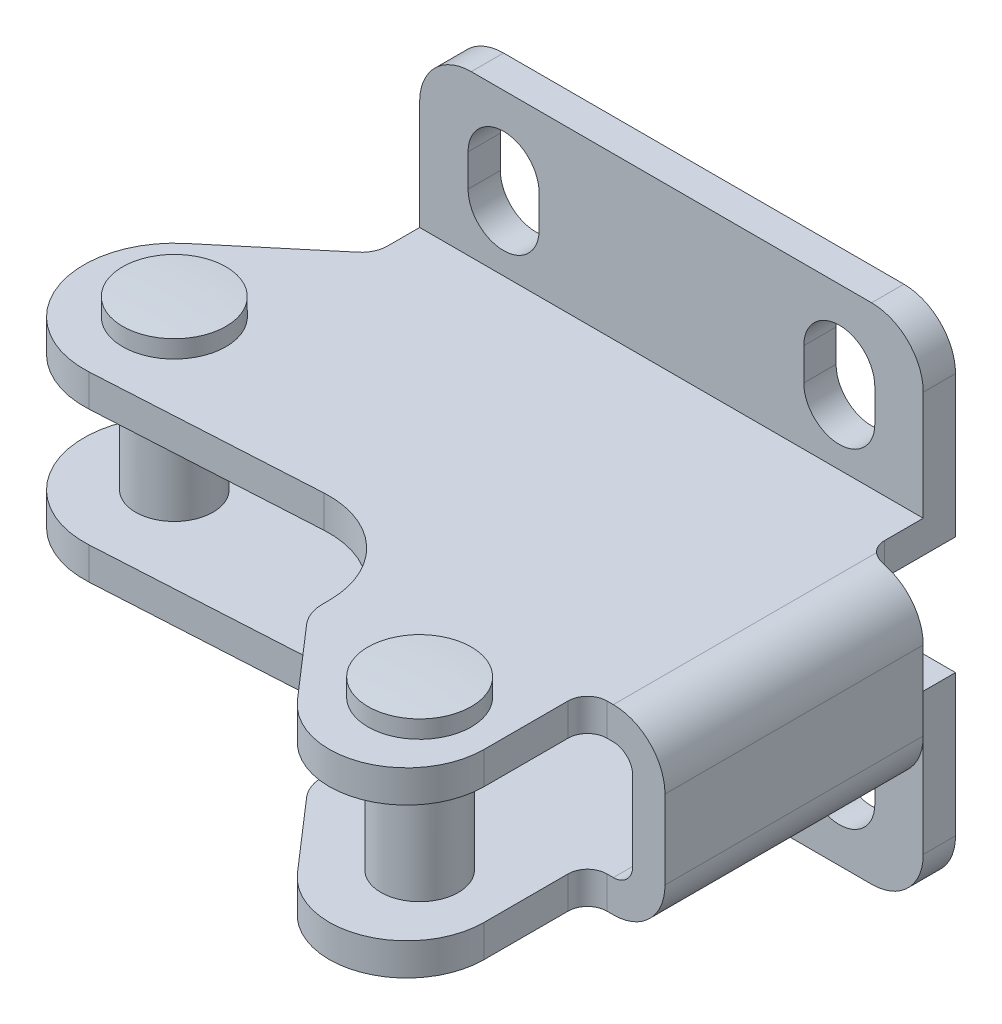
ISO-10303-21;
HEADER;
FILE_DESCRIPTION(('STEP AP214'),'2;1');
FILE_NAME('part.step','',(''),(''),'','','');
FILE_SCHEMA(('AUTOMOTIVE_DESIGN { 1 0 10303 214 1 1 1 1 }'));
ENDSEC;
DATA;
#1=APPLICATION_CONTEXT('core data for automotive mechanical design processes');
#2=APPLICATION_PROTOCOL_DEFINITION('international standard','automotive_design',2000,#1);
#3=PRODUCT_CONTEXT('',#1,'mechanical');
#4=PRODUCT('Part','Part','',(#3));
#5=PRODUCT_RELATED_PRODUCT_CATEGORY('part','',(#4));
#6=PRODUCT_DEFINITION_FORMATION('','',#4);
#7=PRODUCT_DEFINITION_CONTEXT('part definition',#1,'design');
#8=PRODUCT_DEFINITION('design','',#6,#7);
#9=PRODUCT_DEFINITION_SHAPE('','',#8);
#10=(LENGTH_UNIT() NAMED_UNIT(*) SI_UNIT(.MILLI.,.METRE.));
#11=(NAMED_UNIT(*) PLANE_ANGLE_UNIT() SI_UNIT($,.RADIAN.));
#12=(NAMED_UNIT(*) SI_UNIT($,.STERADIAN.) SOLID_ANGLE_UNIT());
#13=UNCERTAINTY_MEASURE_WITH_UNIT(LENGTH_MEASURE(1.E-05),#10,'distance_accuracy_value','');
#14=(GEOMETRIC_REPRESENTATION_CONTEXT(3) GLOBAL_UNCERTAINTY_ASSIGNED_CONTEXT((#13)) GLOBAL_UNIT_ASSIGNED_CONTEXT((#10,
#11,#12)) REPRESENTATION_CONTEXT('',''));
#15=CARTESIAN_POINT('',(0.,0.,0.));
#16=DIRECTION('',(0.,0.,1.));
#17=DIRECTION('',(1.,0.,0.));
#18=AXIS2_PLACEMENT_3D('',#15,#16,#17);
#19=CARTESIAN_POINT('',(25.,7.45,34.));
#20=DIRECTION('',(0.,-1.,0.));
#21=DIRECTION('',(-1.,0.,0.));
#22=AXIS2_PLACEMENT_3D('',#19,#20,#21);
#23=CONICAL_SURFACE('',#22,2.,1.04719755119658);
#24=CARTESIAN_POINT('',(25.,8.6047005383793,34.));
#25=VERTEX_POINT('',#24);
#26=VERTEX_LOOP('',#25);
#27=FACE_BOUND('',#26,.T.);
#28=CARTESIAN_POINT('',(25.,7.45,34.));
#29=DIRECTION('',(0.,1.,0.));
#30=DIRECTION('',(1.,0.,0.));
#31=AXIS2_PLACEMENT_3D('',#28,#29,#30);
#32=CIRCLE('',#31,2.);
#33=CARTESIAN_POINT('',(27.,7.45,34.));
#34=VERTEX_POINT('',#33);
#35=EDGE_CURVE('E1114',#34,#34,#32,.T.);
#36=ORIENTED_EDGE('',*,*,#35,.F.);
#37=EDGE_LOOP('',(#36));
#38=FACE_BOUND('',#37,.T.);
#39=ADVANCED_FACE('F14',(#27,#38),#23,.F.);
#40=CARTESIAN_POINT('',(25.,8.6047005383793,34.));
#41=DIRECTION('',(0.,1.,0.));
#42=DIRECTION('',(1.,0.,0.));
#43=AXIS2_PLACEMENT_3D('',#40,#41,#42);
#44=CYLINDRICAL_SURFACE('',#43,2.);
#45=ORIENTED_EDGE('',*,*,#35,.T.);
#46=EDGE_LOOP('',(#45));
#47=FACE_BOUND('',#46,.T.);
#48=CARTESIAN_POINT('',(25.,5.48334259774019,34.));
#49=DIRECTION('',(0.,1.,0.));
#50=DIRECTION('',(1.,0.,0.));
#51=AXIS2_PLACEMENT_3D('',#48,#49,#50);
#52=CIRCLE('',#51,2.);
#53=CARTESIAN_POINT('',(25.,5.48334259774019,32.0000000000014));
#54=VERTEX_POINT('',#53);
#55=EDGE_CURVE('E1117',#54,#54,#52,.T.);
#56=ORIENTED_EDGE('',*,*,#55,.F.);
#57=EDGE_LOOP('',(#56));
#58=FACE_BOUND('',#57,.T.);
#59=ADVANCED_FACE('F939',(#47,#58),#44,.F.);
#60=CARTESIAN_POINT('',(25.,65.4500000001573,34.0000000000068));
#61=DIRECTION('',(0.,1.,0.));
#62=DIRECTION('',(0.,0.,-1.));
#63=AXIS2_PLACEMENT_3D('',#60,#61,#62);
#64=SPHERICAL_SURFACE('',#63,60.0000000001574);
#65=CARTESIAN_POINT('',(25.,5.5834818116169,34.));
#66=DIRECTION('',(0.,1.,0.));
#67=DIRECTION('',(1.,0.,0.));
#68=AXIS2_PLACEMENT_3D('',#65,#66,#67);
#69=CIRCLE('',#68,4.);
#70=CARTESIAN_POINT('',(25.,5.58348181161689,30.0000000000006));
#71=VERTEX_POINT('',#70);
#72=EDGE_CURVE('E1157',#71,#71,#69,.T.);
#73=CARTESIAN_POINT('',(25.,5.48334259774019,32.0000000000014));
#74=CARTESIAN_POINT('',(25.,5.48403794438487,31.979151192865));
#75=CARTESIAN_POINT('',(25.,5.48474416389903,31.9583027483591));
#76=CARTESIAN_POINT('',(25.,5.48617834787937,31.9166066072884));
#77=CARTESIAN_POINT('',(25.,5.48690631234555,31.8957589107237));
#78=CARTESIAN_POINT('',(25.,5.48838398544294,31.8540642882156));
#79=CARTESIAN_POINT('',(25.,5.48913369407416,31.8332173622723));
#80=CARTESIAN_POINT('',(25.,5.49065485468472,31.7915243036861));
#81=CARTESIAN_POINT('',(25.,5.49142630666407,31.7706781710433));
#82=CARTESIAN_POINT('',(25.,5.49299095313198,31.7289867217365));
#83=CARTESIAN_POINT('',(25.,5.49378414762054,31.7081414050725));
#84=CARTESIAN_POINT('',(25.,5.49539227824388,31.6664516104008));
#85=CARTESIAN_POINT('',(25.,5.49620721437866,31.6456071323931));
#86=CARTESIAN_POINT('',(25.,5.49785882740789,31.6039190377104));
#87=CARTESIAN_POINT('',(25.,5.49869550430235,31.5830754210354));
#88=CARTESIAN_POINT('',(25.,5.50039059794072,31.5413890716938));
#89=CARTESIAN_POINT('',(25.,5.50124901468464,31.5205463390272));
#90=CARTESIAN_POINT('',(25.,5.50298758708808,31.4788617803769));
#91=CARTESIAN_POINT('',(25.,5.50386774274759,31.4580199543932));
#92=CARTESIAN_POINT('',(25.,5.50564979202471,31.4163372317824));
#93=CARTESIAN_POINT('',(25.,5.50655168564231,31.3954963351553));
#94=CARTESIAN_POINT('',(25.,5.50837720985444,31.3538154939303));
#95=CARTESIAN_POINT('',(25.,5.50930084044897,31.3329755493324));
#96=CARTESIAN_POINT('',(25.,5.51116983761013,31.2912966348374));
#97=CARTESIAN_POINT('',(25.,5.51211520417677,31.2704576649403));
#98=CARTESIAN_POINT('',(25.,5.51402767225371,31.2287807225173));
#99=CARTESIAN_POINT('',(25.,5.51499477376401,31.2079427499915));
#100=CARTESIAN_POINT('',(25.,5.51695071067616,31.1662678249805));
#101=CARTESIAN_POINT('',(25.,5.51793954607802,31.1454308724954));
#102=CARTESIAN_POINT('',(25.,5.51993894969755,31.1037580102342));
#103=CARTESIAN_POINT('',(25.,5.52094951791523,31.0829221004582));
#104=CARTESIAN_POINT('',(25.,5.522992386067,31.0412513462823));
#105=CARTESIAN_POINT('',(25.,5.52402468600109,31.0204165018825));
#106=CARTESIAN_POINT('',(25.,5.52611101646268,30.9787479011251));
#107=CARTESIAN_POINT('',(25.,5.52716504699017,30.9579141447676));
#108=CARTESIAN_POINT('',(25.,5.52929483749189,30.9162477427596));
#109=CARTESIAN_POINT('',(25.,5.53037059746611,30.8954150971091));
#110=CARTESIAN_POINT('',(25.,5.53254384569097,30.853750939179));
#111=CARTESIAN_POINT('',(25.,5.53364133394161,30.8329194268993));
#112=CARTESIAN_POINT('',(25.,5.53585803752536,30.7912575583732));
#113=CARTESIAN_POINT('',(25.,5.53697725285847,30.7704272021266));
#114=CARTESIAN_POINT('',(25.,5.53923740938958,30.7287676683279));
#115=CARTESIAN_POINT('',(25.,5.54037835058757,30.7079384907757));
#116=CARTESIAN_POINT('',(25.,5.54268195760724,30.6662813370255));
#117=CARTESIAN_POINT('',(25.,5.5438446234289,30.6454533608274));
#118=CARTESIAN_POINT('',(25.,5.54619167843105,30.6037986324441));
#119=CARTESIAN_POINT('',(25.,5.54737606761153,30.5829718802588));
#120=CARTESIAN_POINT('',(25.,5.54976656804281,30.5413196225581));
#121=CARTESIAN_POINT('',(25.,5.55097267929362,30.5204941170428));
#122=CARTESIAN_POINT('',(25.,5.55340662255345,30.478844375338));
#123=CARTESIAN_POINT('',(25.,5.55463445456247,30.4580201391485));
#124=CARTESIAN_POINT('',(25.,5.55711183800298,30.4163729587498));
#125=CARTESIAN_POINT('',(25.,5.55836138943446,30.3955500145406));
#126=CARTESIAN_POINT('',(25.,5.56088221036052,30.3539054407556));
#127=CARTESIAN_POINT('',(25.,5.5621534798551,30.3330838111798));
#128=CARTESIAN_POINT('',(25.,5.56471773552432,30.2914418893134));
#129=CARTESIAN_POINT('',(25.,5.56601072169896,30.2706215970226));
#130=CARTESIAN_POINT('',(25.,5.56861840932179,30.2289823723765));
#131=CARTESIAN_POINT('',(25.,5.56993311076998,30.208163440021));
#132=CARTESIAN_POINT('',(25.,5.57258422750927,30.1665269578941));
#133=CARTESIAN_POINT('',(25.,5.57392064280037,30.1457094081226));
#134=CARTESIAN_POINT('',(25.,5.57661518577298,30.1040757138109));
#135=CARTESIAN_POINT('',(25.,5.57797331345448,30.0832595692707));
#136=CARTESIAN_POINT('',(25.,5.58071127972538,30.0416287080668));
#137=CARTESIAN_POINT('',(25.,5.58209111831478,30.0208139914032));
#138=CARTESIAN_POINT('',(25.,5.58348181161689,30.0000000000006));
#139=B_SPLINE_CURVE_WITH_KNOTS('',3,(#73,#74,#75,#76,#77,#78,#79,#80,#81,#82,#83,#84,#85,#86,
#87,#88,#89,#90,#91,#92,#93,#94,#95,#96,#97,#98,#99,#100,#101,#102,#103,#104,#105,#106,#107,
#108,#109,#110,#111,#112,#113,#114,#115,#116,#117,#118,#119,#120,#121,#122,#123,#124,#125,#126,
#127,#128,#129,#130,#131,#132,#133,#134,#135,#136,#137,#138),.UNSPECIFIED.,.F.,.F.,(4,2,2,2,2,2,
2,2,2,2,2,2,2,2,2,2,2,2,2,2,2,2,2,2,2,2,2,2,2,2,2,2,4),(0.,0.0625811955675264,0.125162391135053,
0.187743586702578,0.250324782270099,0.312905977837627,0.37548717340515,0.438068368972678,
0.500649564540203,0.563230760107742,0.625811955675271,0.688393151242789,0.750974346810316,
0.813555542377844,0.87613673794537,0.938717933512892,1.00129912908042,1.06388032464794,
1.12646152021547,1.189042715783,1.25162391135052,1.31420510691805,1.37678630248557,
1.4393674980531,1.50194869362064,1.56452988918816,1.62711108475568,1.68969228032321,
1.75227347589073,1.81485467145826,1.87743586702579,1.94001706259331,2.00259825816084),.UNSPECIFIED.);
#140=EDGE_CURVE('BSEAM935',#54,#71,#139,.T.);
#141=ORIENTED_EDGE('',*,*,#55,.T.);
#142=ORIENTED_EDGE('',*,*,#72,.F.);
#143=ORIENTED_EDGE('',*,*,#140,.T.);
#144=ORIENTED_EDGE('',*,*,#140,.F.);
#145=EDGE_LOOP('',(#141,#143,#142,#144));
#146=FACE_BOUND('',#145,.T.);
#147=ADVANCED_FACE('F935',(#146),#64,.T.);
#148=CARTESIAN_POINT('',(25.,8.6047005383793,34.));
#149=DIRECTION('',(0.,1.,0.));
#150=DIRECTION('',(1.,0.,0.));
#151=AXIS2_PLACEMENT_3D('',#148,#149,#150);
#152=CYLINDRICAL_SURFACE('',#151,4.);
#153=ORIENTED_EDGE('',*,*,#72,.T.);
#154=EDGE_LOOP('',(#153));
#155=FACE_BOUND('',#154,.T.);
#156=CARTESIAN_POINT('',(25.,6.95,34.));
#157=DIRECTION('',(0.,1.,0.));
#158=DIRECTION('',(1.,0.,0.));
#159=AXIS2_PLACEMENT_3D('',#156,#157,#158);
#160=CIRCLE('',#159,4.);
#161=CARTESIAN_POINT('',(29.,6.95,34.));
#162=VERTEX_POINT('',#161);
#163=EDGE_CURVE('E1154',#162,#162,#160,.T.);
#164=ORIENTED_EDGE('',*,*,#163,.F.);
#165=EDGE_LOOP('',(#164));
#166=FACE_BOUND('',#165,.T.);
#167=ADVANCED_FACE('F931',(#155,#166),#152,.T.);
#168=CARTESIAN_POINT('',(25.,8.6047005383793,34.));
#169=DIRECTION('',(0.,1.,0.));
#170=DIRECTION('',(1.,0.,0.));
#171=AXIS2_PLACEMENT_3D('',#168,#169,#170);
#172=CYLINDRICAL_SURFACE('',#171,3.);
#173=CARTESIAN_POINT('',(25.,18.55,34.));
#174=DIRECTION('',(0.,-1.,0.));
#175=DIRECTION('',(0.,0.,1.));
#176=AXIS2_PLACEMENT_3D('',#173,#174,#175);
#177=CIRCLE('',#176,3.);
#178=CARTESIAN_POINT('',(25.,18.55,37.));
#179=VERTEX_POINT('',#178);
#180=EDGE_CURVE('E9',#179,#179,#177,.F.);
#181=ORIENTED_EDGE('',*,*,#180,.F.);
#182=EDGE_LOOP('',(#181));
#183=FACE_BOUND('',#182,.T.);
#184=CARTESIAN_POINT('',(25.,9.45,34.));
#185=DIRECTION('',(0.,1.,0.));
#186=DIRECTION('',(0.,0.,-1.));
#187=AXIS2_PLACEMENT_3D('',#184,#185,#186);
#188=CIRCLE('',#187,3.);
#189=CARTESIAN_POINT('',(25.,9.45,31.));
#190=VERTEX_POINT('',#189);
#191=EDGE_CURVE('E24',#190,#190,#188,.F.);
#192=ORIENTED_EDGE('',*,*,#191,.F.);
#193=EDGE_LOOP('',(#192));
#194=FACE_BOUND('',#193,.T.);
#195=ADVANCED_FACE('F924',(#183,#194),#172,.T.);
#196=CARTESIAN_POINT('',(25.,-37.4500000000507,34.0000000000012));
#197=DIRECTION('',(0.,1.,0.));
#198=DIRECTION('',(0.,0.,-1.));
#199=AXIS2_PLACEMENT_3D('',#196,#197,#198);
#200=SPHERICAL_SURFACE('',#199,60.0000000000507);
#201=CARTESIAN_POINT('',(25.,22.4165181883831,34.));
#202=DIRECTION('',(0.,1.,0.));
#203=DIRECTION('',(1.,0.,0.));
#204=AXIS2_PLACEMENT_3D('',#201,#202,#203);
#205=CIRCLE('',#204,3.99999999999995);
#206=CARTESIAN_POINT('',(28.9999999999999,22.4165181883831,34.));
#207=VERTEX_POINT('',#206);
#208=EDGE_CURVE('E1148',#207,#207,#205,.T.);
#209=ORIENTED_EDGE('',*,*,#208,.T.);
#210=EDGE_LOOP('',(#209));
#211=FACE_BOUND('',#210,.T.);
#212=ADVANCED_FACE('F921',(#211),#200,.T.);
#213=CARTESIAN_POINT('',(25.,8.6047005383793,34.));
#214=DIRECTION('',(0.,1.,0.));
#215=DIRECTION('',(1.,0.,0.));
#216=AXIS2_PLACEMENT_3D('',#213,#214,#215);
#217=CYLINDRICAL_SURFACE('',#216,4.);
#218=CARTESIAN_POINT('',(25.,21.05,34.));
#219=DIRECTION('',(0.,1.,0.));
#220=DIRECTION('',(1.,0.,0.));
#221=AXIS2_PLACEMENT_3D('',#218,#219,#220);
#222=CIRCLE('',#221,4.);
#223=CARTESIAN_POINT('',(29.,21.05,34.));
#224=VERTEX_POINT('',#223);
#225=EDGE_CURVE('E1151',#224,#224,#222,.T.);
#226=ORIENTED_EDGE('',*,*,#225,.T.);
#227=EDGE_LOOP('',(#226));
#228=FACE_BOUND('',#227,.T.);
#229=ORIENTED_EDGE('',*,*,#208,.F.);
#230=EDGE_LOOP('',(#229));
#231=FACE_BOUND('',#230,.T.);
#232=ADVANCED_FACE('F919',(#228,#231),#217,.T.);
#233=CARTESIAN_POINT('',(-10.,7.45,18.));
#234=DIRECTION('',(0.,-1.,0.));
#235=DIRECTION('',(-1.,0.,0.));
#236=AXIS2_PLACEMENT_3D('',#233,#234,#235);
#237=CONICAL_SURFACE('',#236,2.,1.04719755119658);
#238=CARTESIAN_POINT('',(-10.,8.6047005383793,18.));
#239=VERTEX_POINT('',#238);
#240=VERTEX_LOOP('',#239);
#241=FACE_BOUND('',#240,.T.);
#242=CARTESIAN_POINT('',(-10.,7.45,18.));
#243=DIRECTION('',(0.,1.,0.));
#244=DIRECTION('',(1.,0.,0.));
#245=AXIS2_PLACEMENT_3D('',#242,#243,#244);
#246=CIRCLE('',#245,2.);
#247=CARTESIAN_POINT('',(-8.,7.45,18.));
#248=VERTEX_POINT('',#247);
#249=EDGE_CURVE('E1111',#248,#248,#246,.T.);
#250=ORIENTED_EDGE('',*,*,#249,.F.);
#251=EDGE_LOOP('',(#250));
#252=FACE_BOUND('',#251,.T.);
#253=ADVANCED_FACE('F842',(#241,#252),#237,.F.);
#254=CARTESIAN_POINT('',(-10.,8.6047005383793,18.));
#255=DIRECTION('',(0.,1.,0.));
#256=DIRECTION('',(1.,0.,0.));
#257=AXIS2_PLACEMENT_3D('',#254,#255,#256);
#258=CYLINDRICAL_SURFACE('',#257,2.);
#259=ORIENTED_EDGE('',*,*,#249,.T.);
#260=EDGE_LOOP('',(#259));
#261=FACE_BOUND('',#260,.T.);
#262=CARTESIAN_POINT('',(-10.,5.48334259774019,18.));
#263=DIRECTION('',(0.,1.,0.));
#264=DIRECTION('',(1.,0.,0.));
#265=AXIS2_PLACEMENT_3D('',#262,#263,#264);
#266=CIRCLE('',#265,2.);
#267=CARTESIAN_POINT('',(-10.,5.48334259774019,16.0000000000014));
#268=VERTEX_POINT('',#267);
#269=EDGE_CURVE('E1142',#268,#268,#266,.T.);
#270=ORIENTED_EDGE('',*,*,#269,.F.);
#271=EDGE_LOOP('',(#270));
#272=FACE_BOUND('',#271,.T.);
#273=ADVANCED_FACE('F870',(#261,#272),#258,.F.);
#274=CARTESIAN_POINT('',(-10.,-37.4500000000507,18.0000000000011));
#275=DIRECTION('',(0.,1.,0.));
#276=DIRECTION('',(0.,0.,-1.));
#277=AXIS2_PLACEMENT_3D('',#274,#275,#276);
#278=SPHERICAL_SURFACE('',#277,60.0000000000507);
#279=CARTESIAN_POINT('',(-10.,22.4165181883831,18.));
#280=DIRECTION('',(0.,1.,0.));
#281=DIRECTION('',(1.,0.,0.));
#282=AXIS2_PLACEMENT_3D('',#279,#280,#281);
#283=CIRCLE('',#282,3.99999999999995);
#284=CARTESIAN_POINT('',(-6.00000000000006,22.4165181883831,18.));
#285=VERTEX_POINT('',#284);
#286=EDGE_CURVE('E1120',#285,#285,#283,.T.);
#287=ORIENTED_EDGE('',*,*,#286,.T.);
#288=EDGE_LOOP('',(#287));
#289=FACE_BOUND('',#288,.T.);
#290=ADVANCED_FACE('F858',(#289),#278,.T.);
#291=CARTESIAN_POINT('',(23.25,28.,2.5));
#292=DIRECTION('',(1.,0.,0.));
#293=DIRECTION('',(0.,1.,0.));
#294=AXIS2_PLACEMENT_3D('',#291,#292,#293);
#295=PLANE('',#294);
#296=DIRECTION('',(0.,-1.,0.));
#297=VECTOR('',#296,1.);
#298=CARTESIAN_POINT('',(23.25,28.,0.));
#299=LINE('',#298,#297);
#300=CARTESIAN_POINT('',(23.25,28.,0.));
#301=VERTEX_POINT('',#300);
#302=CARTESIAN_POINT('',(23.25,25.5,0.));
#303=VERTEX_POINT('',#302);
#304=EDGE_CURVE('E442',#301,#303,#299,.T.);
#305=ORIENTED_EDGE('',*,*,#304,.F.);
#306=DIRECTION('',(0.,0.,-1.));
#307=VECTOR('',#306,1.);
#308=CARTESIAN_POINT('',(23.25,28.,2.5));
#309=LINE('',#308,#307);
#310=CARTESIAN_POINT('',(23.25,28.,2.5));
#311=VERTEX_POINT('',#310);
#312=EDGE_CURVE('E460',#311,#301,#309,.T.);
#313=ORIENTED_EDGE('',*,*,#312,.F.);
#314=DIRECTION('',(0.,-1.,0.));
#315=VECTOR('',#314,1.);
#316=CARTESIAN_POINT('',(23.25,28.,2.5));
#317=LINE('',#316,#315);
#318=CARTESIAN_POINT('',(23.25,25.5,2.5));
#319=VERTEX_POINT('',#318);
#320=EDGE_CURVE('E456',#311,#319,#317,.T.);
#321=ORIENTED_EDGE('',*,*,#320,.T.);
#322=DIRECTION('',(0.,0.,-1.));
#323=VECTOR('',#322,1.);
#324=CARTESIAN_POINT('',(23.25,25.5,2.5));
#325=LINE('',#324,#323);
#326=EDGE_CURVE('E414',#319,#303,#325,.T.);
#327=ORIENTED_EDGE('',*,*,#326,.T.);
#328=EDGE_LOOP('',(#305,#313,#321,#327));
#329=FACE_BOUND('',#328,.T.);
#330=ADVANCED_FACE('F869',(#329),#295,.T.);
#331=CARTESIAN_POINT('',(26.,28.,2.5));
#332=DIRECTION('',(0.,0.,-1.));
#333=DIRECTION('',(0.,-1.,0.));
#334=AXIS2_PLACEMENT_3D('',#331,#332,#333);
#335=CYLINDRICAL_SURFACE('',#334,2.75);
#336=CARTESIAN_POINT('',(26.,28.,0.));
#337=DIRECTION('',(0.,0.,1.));
#338=DIRECTION('',(1.,0.,0.));
#339=AXIS2_PLACEMENT_3D('',#336,#337,#338);
#340=CIRCLE('',#339,2.75);
#341=CARTESIAN_POINT('',(28.75,28.,0.));
#342=VERTEX_POINT('',#341);
#343=EDGE_CURVE('E432',#342,#301,#340,.T.);
#344=ORIENTED_EDGE('',*,*,#343,.F.);
#345=DIRECTION('',(0.,0.,-1.));
#346=VECTOR('',#345,1.);
#347=CARTESIAN_POINT('',(28.75,28.,2.5));
#348=LINE('',#347,#346);
#349=CARTESIAN_POINT('',(28.75,28.,2.5));
#350=VERTEX_POINT('',#349);
#351=EDGE_CURVE('E427',#350,#342,#348,.T.);
#352=ORIENTED_EDGE('',*,*,#351,.F.);
#353=CARTESIAN_POINT('',(26.,28.,2.5));
#354=DIRECTION('',(0.,0.,1.));
#355=DIRECTION('',(1.,0.,0.));
#356=AXIS2_PLACEMENT_3D('',#353,#354,#355);
#357=CIRCLE('',#356,2.75);
#358=EDGE_CURVE('E450',#350,#311,#357,.T.);
#359=ORIENTED_EDGE('',*,*,#358,.T.);
#360=ORIENTED_EDGE('',*,*,#312,.T.);
#361=EDGE_LOOP('',(#344,#352,#359,#360));
#362=FACE_BOUND('',#361,.T.);
#363=ADVANCED_FACE('F877',(#362),#335,.F.);
#364=CARTESIAN_POINT('',(28.75,25.5,2.5));
#365=DIRECTION('',(-1.,0.,0.));
#366=DIRECTION('',(0.,-1.,0.));
#367=AXIS2_PLACEMENT_3D('',#364,#365,#366);
#368=PLANE('',#367);
#369=DIRECTION('',(0.,1.,0.));
#370=VECTOR('',#369,1.);
#371=CARTESIAN_POINT('',(28.75,25.5,0.));
#372=LINE('',#371,#370);
#373=CARTESIAN_POINT('',(28.75,25.5,0.));
#374=VERTEX_POINT('',#373);
#375=EDGE_CURVE('E421',#374,#342,#372,.T.);
#376=ORIENTED_EDGE('',*,*,#375,.F.);
#377=DIRECTION('',(0.,0.,-1.));
#378=VECTOR('',#377,1.);
#379=CARTESIAN_POINT('',(28.75,25.5,2.5));
#380=LINE('',#379,#378);
#381=CARTESIAN_POINT('',(28.75,25.5,2.5));
#382=VERTEX_POINT('',#381);
#383=EDGE_CURVE('E424',#382,#374,#380,.T.);
#384=ORIENTED_EDGE('',*,*,#383,.F.);
#385=DIRECTION('',(0.,1.,0.));
#386=VECTOR('',#385,1.);
#387=CARTESIAN_POINT('',(28.75,25.5,2.5));
#388=LINE('',#387,#386);
#389=EDGE_CURVE('E444',#382,#350,#388,.T.);
#390=ORIENTED_EDGE('',*,*,#389,.T.);
#391=ORIENTED_EDGE('',*,*,#351,.T.);
#392=EDGE_LOOP('',(#376,#384,#390,#391));
#393=FACE_BOUND('',#392,.T.);
#394=ADVANCED_FACE('F423',(#393),#368,.T.);
#395=CARTESIAN_POINT('',(26.,25.5,2.5));
#396=DIRECTION('',(0.,0.,-1.));
#397=DIRECTION('',(0.,-1.,0.));
#398=AXIS2_PLACEMENT_3D('',#395,#396,#397);
#399=CYLINDRICAL_SURFACE('',#398,2.75);
#400=CARTESIAN_POINT('',(26.,25.5,0.));
#401=DIRECTION('',(0.,0.,1.));
#402=DIRECTION('',(-1.,0.,0.));
#403=AXIS2_PLACEMENT_3D('',#400,#401,#402);
#404=CIRCLE('',#403,2.75);
#405=EDGE_CURVE('E435',#303,#374,#404,.T.);
#406=ORIENTED_EDGE('',*,*,#405,.F.);
#407=ORIENTED_EDGE('',*,*,#326,.F.);
#408=CARTESIAN_POINT('',(26.,25.5,2.5));
#409=DIRECTION('',(0.,0.,1.));
#410=DIRECTION('',(-1.,0.,0.));
#411=AXIS2_PLACEMENT_3D('',#408,#409,#410);
#412=CIRCLE('',#411,2.75);
#413=EDGE_CURVE('E438',#319,#382,#412,.T.);
#414=ORIENTED_EDGE('',*,*,#413,.T.);
#415=ORIENTED_EDGE('',*,*,#383,.T.);
#416=EDGE_LOOP('',(#406,#407,#414,#415));
#417=FACE_BOUND('',#416,.T.);
#418=ADVANCED_FACE('F434',(#417),#399,.F.);
#419=CARTESIAN_POINT('',(28.5,29.5,2.5));
#420=DIRECTION('',(0.,0.,-1.));
#421=DIRECTION('',(0.,-1.,0.));
#422=AXIS2_PLACEMENT_3D('',#419,#420,#421);
#423=CYLINDRICAL_SURFACE('',#422,4.00000000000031);
#424=CARTESIAN_POINT('',(28.5,29.5,0.));
#425=DIRECTION('',(0.,0.,1.));
#426=DIRECTION('',(-1.,0.,0.));
#427=AXIS2_PLACEMENT_3D('',#424,#425,#426);
#428=CIRCLE('',#427,4.00000000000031);
#429=CARTESIAN_POINT('',(32.5,29.5,0.));
#430=VERTEX_POINT('',#429);
#431=CARTESIAN_POINT('',(28.5,33.5,0.));
#432=VERTEX_POINT('',#431);
#433=EDGE_CURVE('E1403',#430,#432,#428,.T.);
#434=ORIENTED_EDGE('',*,*,#433,.T.);
#435=DIRECTION('',(0.,0.,-1.));
#436=VECTOR('',#435,1.);
#437=CARTESIAN_POINT('',(28.5,33.5,2.5));
#438=LINE('',#437,#436);
#439=CARTESIAN_POINT('',(28.5,33.5,2.5));
#440=VERTEX_POINT('',#439);
#441=EDGE_CURVE('E1285',#440,#432,#438,.T.);
#442=ORIENTED_EDGE('',*,*,#441,.F.);
#443=CARTESIAN_POINT('',(28.5,29.5,2.5));
#444=DIRECTION('',(0.,0.,1.));
#445=DIRECTION('',(-1.,0.,0.));
#446=AXIS2_PLACEMENT_3D('',#443,#444,#445);
#447=CIRCLE('',#446,4.00000000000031);
#448=CARTESIAN_POINT('',(32.5,29.5,2.5));
#449=VERTEX_POINT('',#448);
#450=EDGE_CURVE('E1268',#449,#440,#447,.T.);
#451=ORIENTED_EDGE('',*,*,#450,.F.);
#452=DIRECTION('',(0.,0.,-1.));
#453=VECTOR('',#452,1.);
#454=CARTESIAN_POINT('',(32.5,29.5,2.5));
#455=LINE('',#454,#453);
#456=EDGE_CURVE('E1288',#449,#430,#455,.T.);
#457=ORIENTED_EDGE('',*,*,#456,.T.);
#458=EDGE_LOOP('',(#434,#442,#451,#457));
#459=FACE_BOUND('',#458,.T.);
#460=ADVANCED_FACE('F761',(#459),#423,.T.);
#461=CARTESIAN_POINT('',(28.5,33.5,2.5));
#462=DIRECTION('',(0.,-1.,0.));
#463=DIRECTION('',(1.,0.,0.));
#464=AXIS2_PLACEMENT_3D('',#461,#462,#463);
#465=PLANE('',#464);
#466=DIRECTION('',(-1.,0.,0.));
#467=VECTOR('',#466,1.);
#468=CARTESIAN_POINT('',(28.5,33.5,0.));
#469=LINE('',#468,#467);
#470=CARTESIAN_POINT('',(-2.5,33.5,0.));
#471=VERTEX_POINT('',#470);
#472=EDGE_CURVE('E1405',#432,#471,#469,.T.);
#473=ORIENTED_EDGE('',*,*,#472,.T.);
#474=DIRECTION('',(0.,0.,-1.));
#475=VECTOR('',#474,1.);
#476=CARTESIAN_POINT('',(-2.5,33.5,2.5));
#477=LINE('',#476,#475);
#478=CARTESIAN_POINT('',(-2.5,33.5,2.5));
#479=VERTEX_POINT('',#478);
#480=EDGE_CURVE('E1282',#479,#471,#477,.T.);
#481=ORIENTED_EDGE('',*,*,#480,.F.);
#482=DIRECTION('',(-1.,0.,0.));
#483=VECTOR('',#482,1.);
#484=CARTESIAN_POINT('',(28.5,33.5,2.5));
#485=LINE('',#484,#483);
#486=EDGE_CURVE('E1256',#440,#479,#485,.T.);
#487=ORIENTED_EDGE('',*,*,#486,.F.);
#488=ORIENTED_EDGE('',*,*,#441,.T.);
#489=EDGE_LOOP('',(#473,#481,#487,#488));
#490=FACE_BOUND('',#489,.T.);
#491=ADVANCED_FACE('F757',(#490),#465,.F.);
#492=CARTESIAN_POINT('',(-2.75,28.,2.5));
#493=DIRECTION('',(1.,0.,0.));
#494=DIRECTION('',(0.,1.,0.));
#495=AXIS2_PLACEMENT_3D('',#492,#493,#494);
#496=PLANE('',#495);
#497=DIRECTION('',(0.,-1.,0.));
#498=VECTOR('',#497,1.);
#499=CARTESIAN_POINT('',(-2.75,28.,0.));
#500=LINE('',#499,#498);
#501=CARTESIAN_POINT('',(-2.75,28.,0.));
#502=VERTEX_POINT('',#501);
#503=CARTESIAN_POINT('',(-2.75,25.5,0.));
#504=VERTEX_POINT('',#503);
#505=EDGE_CURVE('E468',#502,#504,#500,.T.);
#506=ORIENTED_EDGE('',*,*,#505,.F.);
#507=DIRECTION('',(0.,0.,-1.));
#508=VECTOR('',#507,1.);
#509=CARTESIAN_POINT('',(-2.75,28.,2.5));
#510=LINE('',#509,#508);
#511=CARTESIAN_POINT('',(-2.75,28.,2.5));
#512=VERTEX_POINT('',#511);
#513=EDGE_CURVE('E492',#512,#502,#510,.T.);
#514=ORIENTED_EDGE('',*,*,#513,.F.);
#515=DIRECTION('',(0.,-1.,0.));
#516=VECTOR('',#515,1.);
#517=CARTESIAN_POINT('',(-2.75,28.,2.5));
#518=LINE('',#517,#516);
#519=CARTESIAN_POINT('',(-2.75,25.5,2.5));
#520=VERTEX_POINT('',#519);
#521=EDGE_CURVE('E481',#512,#520,#518,.T.);
#522=ORIENTED_EDGE('',*,*,#521,.T.);
#523=DIRECTION('',(0.,0.,-1.));
#524=VECTOR('',#523,1.);
#525=CARTESIAN_POINT('',(-2.75,25.5,2.5));
#526=LINE('',#525,#524);
#527=EDGE_CURVE('E490',#520,#504,#526,.T.);
#528=ORIENTED_EDGE('',*,*,#527,.T.);
#529=EDGE_LOOP('',(#506,#514,#522,#528));
#530=FACE_BOUND('',#529,.T.);
#531=ADVANCED_FACE('F760',(#530),#496,.T.);
#532=CARTESIAN_POINT('',(0.,28.,2.5));
#533=DIRECTION('',(0.,0.,-1.));
#534=DIRECTION('',(0.,-1.,0.));
#535=AXIS2_PLACEMENT_3D('',#532,#533,#534);
#536=CYLINDRICAL_SURFACE('',#535,2.75);
#537=CARTESIAN_POINT('',(0.,28.,0.));
#538=DIRECTION('',(0.,0.,1.));
#539=DIRECTION('',(1.,0.,0.));
#540=AXIS2_PLACEMENT_3D('',#537,#538,#539);
#541=CIRCLE('',#540,2.75);
#542=CARTESIAN_POINT('',(2.75,28.,0.));
#543=VERTEX_POINT('',#542);
#544=EDGE_CURVE('E464',#543,#502,#541,.T.);
#545=ORIENTED_EDGE('',*,*,#544,.F.);
#546=DIRECTION('',(0.,0.,-1.));
#547=VECTOR('',#546,1.);
#548=CARTESIAN_POINT('',(2.75,28.,2.5));
#549=LINE('',#548,#547);
#550=CARTESIAN_POINT('',(2.75,28.,2.5));
#551=VERTEX_POINT('',#550);
#552=EDGE_CURVE('E494',#551,#543,#549,.T.);
#553=ORIENTED_EDGE('',*,*,#552,.F.);
#554=CARTESIAN_POINT('',(0.,28.,2.5));
#555=DIRECTION('',(0.,0.,1.));
#556=DIRECTION('',(1.,0.,0.));
#557=AXIS2_PLACEMENT_3D('',#554,#555,#556);
#558=CIRCLE('',#557,2.75);
#559=EDGE_CURVE('E479',#551,#512,#558,.T.);
#560=ORIENTED_EDGE('',*,*,#559,.T.);
#561=ORIENTED_EDGE('',*,*,#513,.T.);
#562=EDGE_LOOP('',(#545,#553,#560,#561));
#563=FACE_BOUND('',#562,.T.);
#564=ADVANCED_FACE('F965',(#563),#536,.F.);
#565=CARTESIAN_POINT('',(2.75,25.5,2.5));
#566=DIRECTION('',(-1.,0.,0.));
#567=DIRECTION('',(0.,-1.,0.));
#568=AXIS2_PLACEMENT_3D('',#565,#566,#567);
#569=PLANE('',#568);
#570=DIRECTION('',(0.,1.,0.));
#571=VECTOR('',#570,1.);
#572=CARTESIAN_POINT('',(2.75,25.5,0.));
#573=LINE('',#572,#571);
#574=CARTESIAN_POINT('',(2.75,25.5,0.));
#575=VERTEX_POINT('',#574);
#576=EDGE_CURVE('E463',#575,#543,#573,.T.);
#577=ORIENTED_EDGE('',*,*,#576,.F.);
#578=DIRECTION('',(0.,0.,-1.));
#579=VECTOR('',#578,1.);
#580=CARTESIAN_POINT('',(2.75,25.5,2.5));
#581=LINE('',#580,#579);
#582=CARTESIAN_POINT('',(2.75,25.5,2.5));
#583=VERTEX_POINT('',#582);
#584=EDGE_CURVE('E486',#583,#575,#581,.T.);
#585=ORIENTED_EDGE('',*,*,#584,.F.);
#586=DIRECTION('',(0.,1.,0.));
#587=VECTOR('',#586,1.);
#588=CARTESIAN_POINT('',(2.75,25.5,2.5));
#589=LINE('',#588,#587);
#590=EDGE_CURVE('E476',#583,#551,#589,.T.);
#591=ORIENTED_EDGE('',*,*,#590,.T.);
#592=ORIENTED_EDGE('',*,*,#552,.T.);
#593=EDGE_LOOP('',(#577,#585,#591,#592));
#594=FACE_BOUND('',#593,.T.);
#595=ADVANCED_FACE('F961',(#594),#569,.T.);
#596=CARTESIAN_POINT('',(0.,25.5,2.5));
#597=DIRECTION('',(0.,0.,-1.));
#598=DIRECTION('',(0.,-1.,0.));
#599=AXIS2_PLACEMENT_3D('',#596,#597,#598);
#600=CYLINDRICAL_SURFACE('',#599,2.75);
#601=CARTESIAN_POINT('',(0.,25.5,0.));
#602=DIRECTION('',(0.,0.,1.));
#603=DIRECTION('',(-1.,0.,0.));
#604=AXIS2_PLACEMENT_3D('',#601,#602,#603);
#605=CIRCLE('',#604,2.75);
#606=EDGE_CURVE('E472',#504,#575,#605,.T.);
#607=ORIENTED_EDGE('',*,*,#606,.F.);
#608=ORIENTED_EDGE('',*,*,#527,.F.);
#609=CARTESIAN_POINT('',(0.,25.5,2.5));
#610=DIRECTION('',(0.,0.,1.));
#611=DIRECTION('',(-1.,0.,0.));
#612=AXIS2_PLACEMENT_3D('',#609,#610,#611);
#613=CIRCLE('',#612,2.75);
#614=EDGE_CURVE('E484',#520,#583,#613,.T.);
#615=ORIENTED_EDGE('',*,*,#614,.T.);
#616=ORIENTED_EDGE('',*,*,#584,.T.);
#617=EDGE_LOOP('',(#607,#608,#615,#616));
#618=FACE_BOUND('',#617,.T.);
#619=ADVANCED_FACE('F755',(#618),#600,.F.);
#620=CARTESIAN_POINT('',(-2.49999999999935,29.4999999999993,2.5));
#621=DIRECTION('',(0.,0.,-1.));
#622=DIRECTION('',(0.,-1.,0.));
#623=AXIS2_PLACEMENT_3D('',#620,#621,#622);
#624=CYLINDRICAL_SURFACE('',#623,4.00000000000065);
#625=CARTESIAN_POINT('',(-2.49999999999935,29.4999999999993,0.));
#626=DIRECTION('',(0.,0.,1.));
#627=DIRECTION('',(1.,0.,0.));
#628=AXIS2_PLACEMENT_3D('',#625,#626,#627);
#629=CIRCLE('',#628,4.00000000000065);
#630=CARTESIAN_POINT('',(-6.5,29.4999999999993,0.));
#631=VERTEX_POINT('',#630);
#632=EDGE_CURVE('E1410',#471,#631,#629,.T.);
#633=ORIENTED_EDGE('',*,*,#632,.T.);
#634=DIRECTION('',(0.,0.,-1.));
#635=VECTOR('',#634,1.);
#636=CARTESIAN_POINT('',(-6.5,29.4999999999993,2.5));
#637=LINE('',#636,#635);
#638=CARTESIAN_POINT('',(-6.5,29.4999999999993,2.5));
#639=VERTEX_POINT('',#638);
#640=EDGE_CURVE('E1279',#639,#631,#637,.T.);
#641=ORIENTED_EDGE('',*,*,#640,.F.);
#642=CARTESIAN_POINT('',(-2.49999999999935,29.4999999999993,2.5));
#643=DIRECTION('',(0.,0.,1.));
#644=DIRECTION('',(1.,0.,0.));
#645=AXIS2_PLACEMENT_3D('',#642,#643,#644);
#646=CIRCLE('',#645,4.00000000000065);
#647=EDGE_CURVE('E1252',#479,#639,#646,.T.);
#648=ORIENTED_EDGE('',*,*,#647,.F.);
#649=ORIENTED_EDGE('',*,*,#480,.T.);
#650=EDGE_LOOP('',(#633,#641,#648,#649));
#651=FACE_BOUND('',#650,.T.);
#652=ADVANCED_FACE('F751',(#651),#624,.T.);
#653=CARTESIAN_POINT('',(26.,2.5,2.5));
#654=DIRECTION('',(0.,0.,-1.));
#655=DIRECTION('',(0.,-1.,0.));
#656=AXIS2_PLACEMENT_3D('',#653,#654,#655);
#657=CYLINDRICAL_SURFACE('',#656,2.75);
#658=CARTESIAN_POINT('',(26.,2.5,0.));
#659=DIRECTION('',(0.,0.,1.));
#660=DIRECTION('',(1.,0.,0.));
#661=AXIS2_PLACEMENT_3D('',#658,#659,#660);
#662=CIRCLE('',#661,2.75);
#663=CARTESIAN_POINT('',(28.75,2.5,0.));
#664=VERTEX_POINT('',#663);
#665=CARTESIAN_POINT('',(23.25,2.5,0.));
#666=VERTEX_POINT('',#665);
#667=EDGE_CURVE('E502',#664,#666,#662,.T.);
#668=ORIENTED_EDGE('',*,*,#667,.F.);
#669=DIRECTION('',(0.,0.,-1.));
#670=VECTOR('',#669,1.);
#671=CARTESIAN_POINT('',(28.75,2.5,2.5));
#672=LINE('',#671,#670);
#673=CARTESIAN_POINT('',(28.75,2.5,2.5));
#674=VERTEX_POINT('',#673);
#675=EDGE_CURVE('E527',#674,#664,#672,.T.);
#676=ORIENTED_EDGE('',*,*,#675,.F.);
#677=CARTESIAN_POINT('',(26.,2.5,2.5));
#678=DIRECTION('',(0.,0.,1.));
#679=DIRECTION('',(1.,0.,0.));
#680=AXIS2_PLACEMENT_3D('',#677,#678,#679);
#681=CIRCLE('',#680,2.75);
#682=CARTESIAN_POINT('',(23.25,2.5,2.5));
#683=VERTEX_POINT('',#682);
#684=EDGE_CURVE('E516',#674,#683,#681,.T.);
#685=ORIENTED_EDGE('',*,*,#684,.T.);
#686=DIRECTION('',(0.,0.,-1.));
#687=VECTOR('',#686,1.);
#688=CARTESIAN_POINT('',(23.25,2.5,2.5));
#689=LINE('',#688,#687);
#690=EDGE_CURVE('E525',#683,#666,#689,.T.);
#691=ORIENTED_EDGE('',*,*,#690,.T.);
#692=EDGE_LOOP('',(#668,#676,#685,#691));
#693=FACE_BOUND('',#692,.T.);
#694=ADVANCED_FACE('F754',(#693),#657,.F.);
#695=CARTESIAN_POINT('',(23.25,2.5,2.5));
#696=DIRECTION('',(1.,0.,0.));
#697=DIRECTION('',(0.,1.,0.));
#698=AXIS2_PLACEMENT_3D('',#695,#696,#697);
#699=PLANE('',#698);
#700=DIRECTION('',(0.,-1.,0.));
#701=VECTOR('',#700,1.);
#702=CARTESIAN_POINT('',(23.25,2.5,0.));
#703=LINE('',#702,#701);
#704=CARTESIAN_POINT('',(23.25,0.,0.));
#705=VERTEX_POINT('',#704);
#706=EDGE_CURVE('E506',#666,#705,#703,.T.);
#707=ORIENTED_EDGE('',*,*,#706,.F.);
#708=ORIENTED_EDGE('',*,*,#690,.F.);
#709=DIRECTION('',(0.,-1.,0.));
#710=VECTOR('',#709,1.);
#711=CARTESIAN_POINT('',(23.25,2.5,2.5));
#712=LINE('',#711,#710);
#713=CARTESIAN_POINT('',(23.25,0.,2.5));
#714=VERTEX_POINT('',#713);
#715=EDGE_CURVE('E519',#683,#714,#712,.T.);
#716=ORIENTED_EDGE('',*,*,#715,.T.);
#717=DIRECTION('',(0.,0.,-1.));
#718=VECTOR('',#717,1.);
#719=CARTESIAN_POINT('',(23.25,0.,2.5));
#720=LINE('',#719,#718);
#721=EDGE_CURVE('E521',#714,#705,#720,.T.);
#722=ORIENTED_EDGE('',*,*,#721,.T.);
#723=EDGE_LOOP('',(#707,#708,#716,#722));
#724=FACE_BOUND('',#723,.T.);
#725=ADVANCED_FACE('F973',(#724),#699,.T.);
#726=CARTESIAN_POINT('',(26.,0.,2.5));
#727=DIRECTION('',(0.,0.,-1.));
#728=DIRECTION('',(0.,-1.,0.));
#729=AXIS2_PLACEMENT_3D('',#726,#727,#728);
#730=CYLINDRICAL_SURFACE('',#729,2.75);
#731=CARTESIAN_POINT('',(26.,0.,0.));
#732=DIRECTION('',(0.,0.,1.));
#733=DIRECTION('',(-1.,0.,0.));
#734=AXIS2_PLACEMENT_3D('',#731,#732,#733);
#735=CIRCLE('',#734,2.75);
#736=CARTESIAN_POINT('',(28.75,0.,0.));
#737=VERTEX_POINT('',#736);
#738=EDGE_CURVE('E497',#705,#737,#735,.T.);
#739=ORIENTED_EDGE('',*,*,#738,.F.);
#740=ORIENTED_EDGE('',*,*,#721,.F.);
#741=CARTESIAN_POINT('',(26.,0.,2.5));
#742=DIRECTION('',(0.,0.,1.));
#743=DIRECTION('',(-1.,0.,0.));
#744=AXIS2_PLACEMENT_3D('',#741,#742,#743);
#745=CIRCLE('',#744,2.75);
#746=CARTESIAN_POINT('',(28.75,0.,2.5));
#747=VERTEX_POINT('',#746);
#748=EDGE_CURVE('E510',#714,#747,#745,.T.);
#749=ORIENTED_EDGE('',*,*,#748,.T.);
#750=DIRECTION('',(0.,0.,-1.));
#751=VECTOR('',#750,1.);
#752=CARTESIAN_POINT('',(28.75,0.,2.5));
#753=LINE('',#752,#751);
#754=EDGE_CURVE('E529',#747,#737,#753,.T.);
#755=ORIENTED_EDGE('',*,*,#754,.T.);
#756=EDGE_LOOP('',(#739,#740,#749,#755));
#757=FACE_BOUND('',#756,.T.);
#758=ADVANCED_FACE('F976',(#757),#730,.F.);
#759=CARTESIAN_POINT('',(28.75,0.,2.5));
#760=DIRECTION('',(-1.,0.,0.));
#761=DIRECTION('',(0.,-1.,0.));
#762=AXIS2_PLACEMENT_3D('',#759,#760,#761);
#763=PLANE('',#762);
#764=DIRECTION('',(0.,1.,0.));
#765=VECTOR('',#764,1.);
#766=CARTESIAN_POINT('',(28.75,0.,0.));
#767=LINE('',#766,#765);
#768=EDGE_CURVE('E498',#737,#664,#767,.T.);
#769=ORIENTED_EDGE('',*,*,#768,.F.);
#770=ORIENTED_EDGE('',*,*,#754,.F.);
#771=DIRECTION('',(0.,1.,0.));
#772=VECTOR('',#771,1.);
#773=CARTESIAN_POINT('',(28.75,0.,2.5));
#774=LINE('',#773,#772);
#775=EDGE_CURVE('E514',#747,#674,#774,.T.);
#776=ORIENTED_EDGE('',*,*,#775,.T.);
#777=ORIENTED_EDGE('',*,*,#675,.T.);
#778=EDGE_LOOP('',(#769,#770,#776,#777));
#779=FACE_BOUND('',#778,.T.);
#780=ADVANCED_FACE('F741',(#779),#763,.T.);
#781=CARTESIAN_POINT('',(28.5,-1.4999999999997,2.5));
#782=DIRECTION('',(0.,0.,-1.));
#783=DIRECTION('',(0.,-1.,0.));
#784=AXIS2_PLACEMENT_3D('',#781,#782,#783);
#785=CYLINDRICAL_SURFACE('',#784,4.00000000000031);
#786=CARTESIAN_POINT('',(28.5,-1.4999999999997,0.));
#787=DIRECTION('',(0.,0.,1.));
#788=DIRECTION('',(-1.,0.,0.));
#789=AXIS2_PLACEMENT_3D('',#786,#787,#788);
#790=CIRCLE('',#789,4.00000000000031);
#791=CARTESIAN_POINT('',(28.5,-5.5,0.));
#792=VERTEX_POINT('',#791);
#793=CARTESIAN_POINT('',(32.5,-1.5,0.));
#794=VERTEX_POINT('',#793);
#795=EDGE_CURVE('E1420',#792,#794,#790,.T.);
#796=ORIENTED_EDGE('',*,*,#795,.T.);
#797=DIRECTION('',(0.,0.,-1.));
#798=VECTOR('',#797,1.);
#799=CARTESIAN_POINT('',(32.5,-1.5,2.5));
#800=LINE('',#799,#798);
#801=CARTESIAN_POINT('',(32.5,-1.5,2.5));
#802=VERTEX_POINT('',#801);
#803=EDGE_CURVE('E1265',#802,#794,#800,.T.);
#804=ORIENTED_EDGE('',*,*,#803,.F.);
#805=CARTESIAN_POINT('',(28.5,-1.4999999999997,2.5));
#806=DIRECTION('',(0.,0.,1.));
#807=DIRECTION('',(-1.,0.,0.));
#808=AXIS2_PLACEMENT_3D('',#805,#806,#807);
#809=CIRCLE('',#808,4.00000000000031);
#810=CARTESIAN_POINT('',(28.5,-5.5,2.5));
#811=VERTEX_POINT('',#810);
#812=EDGE_CURVE('E1263',#811,#802,#809,.T.);
#813=ORIENTED_EDGE('',*,*,#812,.F.);
#814=DIRECTION('',(0.,0.,-1.));
#815=VECTOR('',#814,1.);
#816=CARTESIAN_POINT('',(28.5,-5.5,2.5));
#817=LINE('',#816,#815);
#818=EDGE_CURVE('E1272',#811,#792,#817,.T.);
#819=ORIENTED_EDGE('',*,*,#818,.T.);
#820=EDGE_LOOP('',(#796,#804,#813,#819));
#821=FACE_BOUND('',#820,.T.);
#822=ADVANCED_FACE('F730',(#821),#785,.T.);
#823=CARTESIAN_POINT('',(-2.5,-5.5,2.5));
#824=DIRECTION('',(0.,1.,0.));
#825=DIRECTION('',(-1.,0.,0.));
#826=AXIS2_PLACEMENT_3D('',#823,#824,#825);
#827=PLANE('',#826);
#828=DIRECTION('',(1.,0.,0.));
#829=VECTOR('',#828,1.);
#830=CARTESIAN_POINT('',(-2.5,-5.5,0.));
#831=LINE('',#830,#829);
#832=CARTESIAN_POINT('',(-2.5,-5.5,0.));
#833=VERTEX_POINT('',#832);
#834=EDGE_CURVE('E1417',#833,#792,#831,.T.);
#835=ORIENTED_EDGE('',*,*,#834,.T.);
#836=ORIENTED_EDGE('',*,*,#818,.F.);
#837=DIRECTION('',(1.,0.,0.));
#838=VECTOR('',#837,1.);
#839=CARTESIAN_POINT('',(-2.5,-5.5,2.5));
#840=LINE('',#839,#838);
#841=CARTESIAN_POINT('',(-2.5,-5.5,2.5));
#842=VERTEX_POINT('',#841);
#843=EDGE_CURVE('E1261',#842,#811,#840,.T.);
#844=ORIENTED_EDGE('',*,*,#843,.F.);
#845=DIRECTION('',(0.,0.,-1.));
#846=VECTOR('',#845,1.);
#847=CARTESIAN_POINT('',(-2.5,-5.5,2.5));
#848=LINE('',#847,#846);
#849=EDGE_CURVE('E1275',#842,#833,#848,.T.);
#850=ORIENTED_EDGE('',*,*,#849,.T.);
#851=EDGE_LOOP('',(#835,#836,#844,#850));
#852=FACE_BOUND('',#851,.T.);
#853=ADVANCED_FACE('F740',(#852),#827,.F.);
#854=CARTESIAN_POINT('',(0.,2.5,2.5));
#855=DIRECTION('',(0.,0.,-1.));
#856=DIRECTION('',(0.,-1.,0.));
#857=AXIS2_PLACEMENT_3D('',#854,#855,#856);
#858=CYLINDRICAL_SURFACE('',#857,2.75);
#859=CARTESIAN_POINT('',(0.,2.5,0.));
#860=DIRECTION('',(0.,0.,1.));
#861=DIRECTION('',(1.,0.,0.));
#862=AXIS2_PLACEMENT_3D('',#859,#860,#861);
#863=CIRCLE('',#862,2.75);
#864=CARTESIAN_POINT('',(2.75,2.5,0.));
#865=VERTEX_POINT('',#864);
#866=CARTESIAN_POINT('',(-2.75,2.5,0.));
#867=VERTEX_POINT('',#866);
#868=EDGE_CURVE('E537',#865,#867,#863,.T.);
#869=ORIENTED_EDGE('',*,*,#868,.F.);
#870=DIRECTION('',(0.,0.,-1.));
#871=VECTOR('',#870,1.);
#872=CARTESIAN_POINT('',(2.75,2.5,2.5));
#873=LINE('',#872,#871);
#874=CARTESIAN_POINT('',(2.75,2.5,2.5));
#875=VERTEX_POINT('',#874);
#876=EDGE_CURVE('E562',#875,#865,#873,.T.);
#877=ORIENTED_EDGE('',*,*,#876,.F.);
#878=CARTESIAN_POINT('',(0.,2.5,2.5));
#879=DIRECTION('',(0.,0.,1.));
#880=DIRECTION('',(1.,0.,0.));
#881=AXIS2_PLACEMENT_3D('',#878,#879,#880);
#882=CIRCLE('',#881,2.75);
#883=CARTESIAN_POINT('',(-2.75,2.5,2.5));
#884=VERTEX_POINT('',#883);
#885=EDGE_CURVE('E551',#875,#884,#882,.T.);
#886=ORIENTED_EDGE('',*,*,#885,.T.);
#887=DIRECTION('',(0.,0.,-1.));
#888=VECTOR('',#887,1.);
#889=CARTESIAN_POINT('',(-2.75,2.5,2.5));
#890=LINE('',#889,#888);
#891=EDGE_CURVE('E560',#884,#867,#890,.T.);
#892=ORIENTED_EDGE('',*,*,#891,.T.);
#893=EDGE_LOOP('',(#869,#877,#886,#892));
#894=FACE_BOUND('',#893,.T.);
#895=ADVANCED_FACE('F745',(#894),#858,.F.);
#896=CARTESIAN_POINT('',(-2.75,2.5,2.5));
#897=DIRECTION('',(1.,0.,0.));
#898=DIRECTION('',(0.,1.,0.));
#899=AXIS2_PLACEMENT_3D('',#896,#897,#898);
#900=PLANE('',#899);
#901=DIRECTION('',(0.,-1.,0.));
#902=VECTOR('',#901,1.);
#903=CARTESIAN_POINT('',(-2.75,2.5,0.));
#904=LINE('',#903,#902);
#905=CARTESIAN_POINT('',(-2.75,0.,0.));
#906=VERTEX_POINT('',#905);
#907=EDGE_CURVE('E541',#867,#906,#904,.T.);
#908=ORIENTED_EDGE('',*,*,#907,.F.);
#909=ORIENTED_EDGE('',*,*,#891,.F.);
#910=DIRECTION('',(0.,-1.,0.));
#911=VECTOR('',#910,1.);
#912=CARTESIAN_POINT('',(-2.75,2.5,2.5));
#913=LINE('',#912,#911);
#914=CARTESIAN_POINT('',(-2.75,0.,2.5));
#915=VERTEX_POINT('',#914);
#916=EDGE_CURVE('E554',#884,#915,#913,.T.);
#917=ORIENTED_EDGE('',*,*,#916,.T.);
#918=DIRECTION('',(0.,0.,-1.));
#919=VECTOR('',#918,1.);
#920=CARTESIAN_POINT('',(-2.75,0.,2.5));
#921=LINE('',#920,#919);
#922=EDGE_CURVE('E556',#915,#906,#921,.T.);
#923=ORIENTED_EDGE('',*,*,#922,.T.);
#924=EDGE_LOOP('',(#908,#909,#917,#923));
#925=FACE_BOUND('',#924,.T.);
#926=ADVANCED_FACE('F987',(#925),#900,.T.);
#927=CARTESIAN_POINT('',(0.,0.,2.5));
#928=DIRECTION('',(0.,0.,-1.));
#929=DIRECTION('',(0.,-1.,0.));
#930=AXIS2_PLACEMENT_3D('',#927,#928,#929);
#931=CYLINDRICAL_SURFACE('',#930,2.75);
#932=CARTESIAN_POINT('',(0.,0.,0.));
#933=DIRECTION('',(0.,0.,1.));
#934=DIRECTION('',(-1.,0.,0.));
#935=AXIS2_PLACEMENT_3D('',#932,#933,#934);
#936=CIRCLE('',#935,2.75);
#937=CARTESIAN_POINT('',(2.75,0.,0.));
#938=VERTEX_POINT('',#937);
#939=EDGE_CURVE('E532',#906,#938,#936,.T.);
#940=ORIENTED_EDGE('',*,*,#939,.F.);
#941=ORIENTED_EDGE('',*,*,#922,.F.);
#942=CARTESIAN_POINT('',(0.,0.,2.5));
#943=DIRECTION('',(0.,0.,1.));
#944=DIRECTION('',(-1.,0.,0.));
#945=AXIS2_PLACEMENT_3D('',#942,#943,#944);
#946=CIRCLE('',#945,2.75);
#947=CARTESIAN_POINT('',(2.75,0.,2.5));
#948=VERTEX_POINT('',#947);
#949=EDGE_CURVE('E545',#915,#948,#946,.T.);
#950=ORIENTED_EDGE('',*,*,#949,.T.);
#951=DIRECTION('',(0.,0.,-1.));
#952=VECTOR('',#951,1.);
#953=CARTESIAN_POINT('',(2.75,0.,2.5));
#954=LINE('',#953,#952);
#955=EDGE_CURVE('E564',#948,#938,#954,.T.);
#956=ORIENTED_EDGE('',*,*,#955,.T.);
#957=EDGE_LOOP('',(#940,#941,#950,#956));
#958=FACE_BOUND('',#957,.T.);
#959=ADVANCED_FACE('F990',(#958),#931,.F.);
#960=CARTESIAN_POINT('',(2.75,0.,2.5));
#961=DIRECTION('',(-1.,0.,0.));
#962=DIRECTION('',(0.,-1.,0.));
#963=AXIS2_PLACEMENT_3D('',#960,#961,#962);
#964=PLANE('',#963);
#965=DIRECTION('',(0.,1.,0.));
#966=VECTOR('',#965,1.);
#967=CARTESIAN_POINT('',(2.75,0.,0.));
#968=LINE('',#967,#966);
#969=EDGE_CURVE('E533',#938,#865,#968,.T.);
#970=ORIENTED_EDGE('',*,*,#969,.F.);
#971=ORIENTED_EDGE('',*,*,#955,.F.);
#972=DIRECTION('',(0.,1.,0.));
#973=VECTOR('',#972,1.);
#974=CARTESIAN_POINT('',(2.75,0.,2.5));
#975=LINE('',#974,#973);
#976=EDGE_CURVE('E549',#948,#875,#975,.T.);
#977=ORIENTED_EDGE('',*,*,#976,.T.);
#978=ORIENTED_EDGE('',*,*,#876,.T.);
#979=EDGE_LOOP('',(#970,#971,#977,#978));
#980=FACE_BOUND('',#979,.T.);
#981=ADVANCED_FACE('F749',(#980),#964,.T.);
#982=CARTESIAN_POINT('',(-2.49999999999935,-1.49999999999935,2.5));
#983=DIRECTION('',(0.,0.,-1.));
#984=DIRECTION('',(0.,-1.,0.));
#985=AXIS2_PLACEMENT_3D('',#982,#983,#984);
#986=CYLINDRICAL_SURFACE('',#985,4.00000000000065);
#987=CARTESIAN_POINT('',(-2.49999999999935,-1.49999999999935,0.));
#988=DIRECTION('',(0.,0.,1.));
#989=DIRECTION('',(-1.,0.,0.));
#990=AXIS2_PLACEMENT_3D('',#987,#988,#989);
#991=CIRCLE('',#990,4.00000000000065);
#992=CARTESIAN_POINT('',(-6.5,-1.5,0.));
#993=VERTEX_POINT('',#992);
#994=EDGE_CURVE('E1414',#993,#833,#991,.T.);
#995=ORIENTED_EDGE('',*,*,#994,.T.);
#996=ORIENTED_EDGE('',*,*,#849,.F.);
#997=CARTESIAN_POINT('',(-2.49999999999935,-1.49999999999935,2.5));
#998=DIRECTION('',(0.,0.,1.));
#999=DIRECTION('',(-1.,0.,0.));
#1000=AXIS2_PLACEMENT_3D('',#997,#998,#999);
#1001=CIRCLE('',#1000,4.00000000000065);
#1002=CARTESIAN_POINT('',(-6.5,-1.5,2.5));
#1003=VERTEX_POINT('',#1002);
#1004=EDGE_CURVE('E1255',#1003,#842,#1001,.T.);
#1005=ORIENTED_EDGE('',*,*,#1004,.F.);
#1006=DIRECTION('',(0.,0.,-1.));
#1007=VECTOR('',#1006,1.);
#1008=CARTESIAN_POINT('',(-6.5,-1.5,2.5));
#1009=LINE('',#1008,#1007);
#1010=EDGE_CURVE('E1248',#1003,#993,#1009,.T.);
#1011=ORIENTED_EDGE('',*,*,#1010,.T.);
#1012=EDGE_LOOP('',(#995,#996,#1005,#1011));
#1013=FACE_BOUND('',#1012,.T.);
#1014=ADVANCED_FACE('F728',(#1013),#986,.T.);
#1015=CARTESIAN_POINT('',(34.5,10.95,41.));
#1016=DIRECTION('',(-1.,0.,0.));
#1017=DIRECTION('',(0.,-1.,0.));
#1018=AXIS2_PLACEMENT_3D('',#1015,#1016,#1017);
#1019=PLANE('',#1018);
#1020=DIRECTION('',(0.,0.,-1.));
#1021=VECTOR('',#1020,1.);
#1022=CARTESIAN_POINT('',(34.5,10.95,41.));
#1023=LINE('',#1022,#1021);
#1024=CARTESIAN_POINT('',(34.5,10.95,27.));
#1025=VERTEX_POINT('',#1024);
#1026=CARTESIAN_POINT('',(34.5,10.95,7.));
#1027=VERTEX_POINT('',#1026);
#1028=EDGE_CURVE('E1382',#1025,#1027,#1023,.T.);
#1029=ORIENTED_EDGE('',*,*,#1028,.F.);
#1030=DIRECTION('',(0.,-1.,0.));
#1031=VECTOR('',#1030,1.);
#1032=CARTESIAN_POINT('',(34.5,6.95,27.));
#1033=LINE('',#1032,#1031);
#1034=CARTESIAN_POINT('',(34.5,17.05,27.));
#1035=VERTEX_POINT('',#1034);
#1036=EDGE_CURVE('E1103',#1035,#1025,#1033,.T.);
#1037=ORIENTED_EDGE('',*,*,#1036,.F.);
#1038=DIRECTION('',(0.,0.,-1.));
#1039=VECTOR('',#1038,1.);
#1040=CARTESIAN_POINT('',(34.5,17.05,41.));
#1041=LINE('',#1040,#1039);
#1042=CARTESIAN_POINT('',(34.5,17.05,7.));
#1043=VERTEX_POINT('',#1042);
#1044=EDGE_CURVE('E623',#1035,#1043,#1041,.T.);
#1045=ORIENTED_EDGE('',*,*,#1044,.T.);
#1046=DIRECTION('',(0.,1.,0.));
#1047=VECTOR('',#1046,1.);
#1048=CARTESIAN_POINT('',(34.5,6.95,7.));
#1049=LINE('',#1048,#1047);
#1050=EDGE_CURVE('E1402',#1027,#1043,#1049,.T.);
#1051=ORIENTED_EDGE('',*,*,#1050,.F.);
#1052=EDGE_LOOP('',(#1029,#1037,#1045,#1051));
#1053=FACE_BOUND('',#1052,.T.);
#1054=ADVANCED_FACE('F725',(#1053),#1019,.T.);
#1055=CARTESIAN_POINT('',(37.,6.95,27.));
#1056=DIRECTION('',(1.,0.,0.));
#1057=DIRECTION('',(0.,1.,0.));
#1058=AXIS2_PLACEMENT_3D('',#1055,#1056,#1057);
#1059=PLANE('',#1058);
#1060=DIRECTION('',(0.,0.,-1.));
#1061=VECTOR('',#1060,1.);
#1062=CARTESIAN_POINT('',(37.,17.05,41.));
#1063=LINE('',#1062,#1061);
#1064=CARTESIAN_POINT('',(37.,17.05,27.));
#1065=VERTEX_POINT('',#1064);
#1066=CARTESIAN_POINT('',(37.,17.05,7.));
#1067=VERTEX_POINT('',#1066);
#1068=EDGE_CURVE('E572',#1065,#1067,#1063,.T.);
#1069=ORIENTED_EDGE('',*,*,#1068,.F.);
#1070=DIRECTION('',(0.,1.,0.));
#1071=VECTOR('',#1070,1.);
#1072=CARTESIAN_POINT('',(37.,6.95,27.));
#1073=LINE('',#1072,#1071);
#1074=CARTESIAN_POINT('',(37.,10.95,27.));
#1075=VERTEX_POINT('',#1074);
#1076=EDGE_CURVE('E1018',#1075,#1065,#1073,.T.);
#1077=ORIENTED_EDGE('',*,*,#1076,.F.);
#1078=DIRECTION('',(0.,0.,-1.));
#1079=VECTOR('',#1078,1.);
#1080=CARTESIAN_POINT('',(37.,10.95,41.));
#1081=LINE('',#1080,#1079);
#1082=CARTESIAN_POINT('',(37.,10.95,7.));
#1083=VERTEX_POINT('',#1082);
#1084=EDGE_CURVE('E569',#1075,#1083,#1081,.T.);
#1085=ORIENTED_EDGE('',*,*,#1084,.T.);
#1086=DIRECTION('',(0.,1.,0.));
#1087=VECTOR('',#1086,1.);
#1088=CARTESIAN_POINT('',(37.,6.95,7.));
#1089=LINE('',#1088,#1087);
#1090=EDGE_CURVE('E1093',#1083,#1067,#1089,.T.);
#1091=ORIENTED_EDGE('',*,*,#1090,.T.);
#1092=EDGE_LOOP('',(#1069,#1077,#1085,#1091));
#1093=FACE_BOUND('',#1092,.T.);
#1094=ADVANCED_FACE('F16',(#1093),#1059,.T.);
#1095=CARTESIAN_POINT('',(37.,6.95,7.));
#1096=DIRECTION('',(0.,0.,-1.));
#1097=DIRECTION('',(0.,-1.,0.));
#1098=AXIS2_PLACEMENT_3D('',#1095,#1096,#1097);
#1099=PLANE('',#1098);
#1100=DIRECTION('',(0.,1.,0.));
#1101=VECTOR('',#1100,1.);
#1102=CARTESIAN_POINT('',(34.,6.95,7.));
#1103=LINE('',#1102,#1101);
#1104=CARTESIAN_POINT('',(34.,18.1680339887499,7.));
#1105=VERTEX_POINT('',#1104);
#1106=CARTESIAN_POINT('',(34.,20.9229833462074,7.));
#1107=VERTEX_POINT('',#1106);
#1108=EDGE_CURVE('E1090',#1105,#1107,#1103,.T.);
#1109=ORIENTED_EDGE('',*,*,#1108,.T.);
#1110=CARTESIAN_POINT('',(33.,17.05,7.));
#1111=DIRECTION('',(0.,0.,-1.));
#1112=DIRECTION('',(0.,-1.,0.));
#1113=AXIS2_PLACEMENT_3D('',#1110,#1111,#1112);
#1114=CIRCLE('',#1113,4.);
#1115=EDGE_CURVE('E589',#1107,#1067,#1114,.T.);
#1116=ORIENTED_EDGE('',*,*,#1115,.T.);
#1117=ORIENTED_EDGE('',*,*,#1090,.F.);
#1118=CARTESIAN_POINT('',(33.,10.95,7.));
#1119=DIRECTION('',(0.,0.,-1.));
#1120=DIRECTION('',(0.,-1.,0.));
#1121=AXIS2_PLACEMENT_3D('',#1118,#1119,#1120);
#1122=CIRCLE('',#1121,4.);
#1123=CARTESIAN_POINT('',(34.,7.07701665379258,7.));
#1124=VERTEX_POINT('',#1123);
#1125=EDGE_CURVE('E1011',#1083,#1124,#1122,.T.);
#1126=ORIENTED_EDGE('',*,*,#1125,.T.);
#1127=CARTESIAN_POINT('',(34.,9.83196601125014,7.));
#1128=VERTEX_POINT('',#1127);
#1129=EDGE_CURVE('E1091',#1124,#1128,#1103,.T.);
#1130=ORIENTED_EDGE('',*,*,#1129,.T.);
#1131=CARTESIAN_POINT('',(33.,10.95,7.));
#1132=DIRECTION('',(0.,0.,-1.));
#1133=DIRECTION('',(0.,-1.,0.));
#1134=AXIS2_PLACEMENT_3D('',#1131,#1132,#1133);
#1135=CIRCLE('',#1134,1.50000000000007);
#1136=EDGE_CURVE('E622',#1128,#1027,#1135,.F.);
#1137=ORIENTED_EDGE('',*,*,#1136,.T.);
#1138=ORIENTED_EDGE('',*,*,#1050,.T.);
#1139=CARTESIAN_POINT('',(33.,17.05,7.));
#1140=DIRECTION('',(0.,0.,-1.));
#1141=DIRECTION('',(0.,-1.,0.));
#1142=AXIS2_PLACEMENT_3D('',#1139,#1140,#1141);
#1143=CIRCLE('',#1142,1.50000000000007);
#1144=EDGE_CURVE('E717',#1043,#1105,#1143,.F.);
#1145=ORIENTED_EDGE('',*,*,#1144,.T.);
#1146=EDGE_LOOP('',(#1109,#1116,#1117,#1126,#1130,#1137,#1138,#1145));
#1147=FACE_BOUND('',#1146,.T.);
#1148=ADVANCED_FACE('F851',(#1147),#1099,.T.);
#1149=CARTESIAN_POINT('',(-10.,65.4500000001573,18.0000000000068));
#1150=DIRECTION('',(0.,1.,0.));
#1151=DIRECTION('',(0.,0.,-1.));
#1152=AXIS2_PLACEMENT_3D('',#1149,#1150,#1151);
#1153=SPHERICAL_SURFACE('',#1152,60.0000000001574);
#1154=CARTESIAN_POINT('',(-10.,5.5834818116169,18.));
#1155=DIRECTION('',(0.,1.,0.));
#1156=DIRECTION('',(1.,0.,0.));
#1157=AXIS2_PLACEMENT_3D('',#1154,#1155,#1156);
#1158=CIRCLE('',#1157,4.);
#1159=CARTESIAN_POINT('',(-10.,5.58348181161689,14.0000000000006));
#1160=VERTEX_POINT('',#1159);
#1161=EDGE_CURVE('E1140',#1160,#1160,#1158,.T.);
#1162=CARTESIAN_POINT('',(-10.,5.48334259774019,16.0000000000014));
#1163=CARTESIAN_POINT('',(-10.,5.48403794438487,15.979151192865));
#1164=CARTESIAN_POINT('',(-10.,5.48474416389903,15.9583027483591));
#1165=CARTESIAN_POINT('',(-10.,5.48617834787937,15.9166066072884));
#1166=CARTESIAN_POINT('',(-10.,5.48690631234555,15.8957589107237));
#1167=CARTESIAN_POINT('',(-10.,5.48838398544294,15.8540642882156));
#1168=CARTESIAN_POINT('',(-10.,5.48913369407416,15.8332173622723));
#1169=CARTESIAN_POINT('',(-10.,5.49065485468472,15.7915243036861));
#1170=CARTESIAN_POINT('',(-10.,5.49142630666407,15.7706781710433));
#1171=CARTESIAN_POINT('',(-10.,5.49299095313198,15.7289867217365));
#1172=CARTESIAN_POINT('',(-10.,5.49378414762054,15.7081414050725));
#1173=CARTESIAN_POINT('',(-10.,5.49539227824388,15.6664516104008));
#1174=CARTESIAN_POINT('',(-10.,5.49620721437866,15.6456071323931));
#1175=CARTESIAN_POINT('',(-10.,5.49785882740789,15.6039190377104));
#1176=CARTESIAN_POINT('',(-10.,5.49869550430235,15.5830754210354));
#1177=CARTESIAN_POINT('',(-10.,5.50039059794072,15.5413890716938));
#1178=CARTESIAN_POINT('',(-10.,5.50124901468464,15.5205463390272));
#1179=CARTESIAN_POINT('',(-10.,5.50298758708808,15.4788617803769));
#1180=CARTESIAN_POINT('',(-10.,5.50386774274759,15.4580199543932));
#1181=CARTESIAN_POINT('',(-10.,5.50564979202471,15.4163372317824));
#1182=CARTESIAN_POINT('',(-10.,5.50655168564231,15.3954963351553));
#1183=CARTESIAN_POINT('',(-10.,5.50837720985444,15.3538154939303));
#1184=CARTESIAN_POINT('',(-10.,5.50930084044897,15.3329755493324));
#1185=CARTESIAN_POINT('',(-10.,5.51116983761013,15.2912966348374));
#1186=CARTESIAN_POINT('',(-10.,5.51211520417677,15.2704576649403));
#1187=CARTESIAN_POINT('',(-10.,5.51402767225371,15.2287807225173));
#1188=CARTESIAN_POINT('',(-10.,5.51499477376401,15.2079427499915));
#1189=CARTESIAN_POINT('',(-10.,5.51695071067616,15.1662678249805));
#1190=CARTESIAN_POINT('',(-10.,5.51793954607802,15.1454308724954));
#1191=CARTESIAN_POINT('',(-10.,5.51993894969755,15.1037580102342));
#1192=CARTESIAN_POINT('',(-10.,5.52094951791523,15.0829221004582));
#1193=CARTESIAN_POINT('',(-10.,5.522992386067,15.0412513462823));
#1194=CARTESIAN_POINT('',(-10.,5.52402468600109,15.0204165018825));
#1195=CARTESIAN_POINT('',(-10.,5.52611101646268,14.9787479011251));
#1196=CARTESIAN_POINT('',(-10.,5.52716504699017,14.9579141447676));
#1197=CARTESIAN_POINT('',(-10.,5.52929483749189,14.9162477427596));
#1198=CARTESIAN_POINT('',(-10.,5.53037059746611,14.8954150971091));
#1199=CARTESIAN_POINT('',(-10.,5.53254384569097,14.853750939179));
#1200=CARTESIAN_POINT('',(-10.,5.53364133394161,14.8329194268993));
#1201=CARTESIAN_POINT('',(-10.,5.53585803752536,14.7912575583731));
#1202=CARTESIAN_POINT('',(-10.,5.53697725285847,14.7704272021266));
#1203=CARTESIAN_POINT('',(-10.,5.53923740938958,14.7287676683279));
#1204=CARTESIAN_POINT('',(-10.,5.54037835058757,14.7079384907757));
#1205=CARTESIAN_POINT('',(-10.,5.54268195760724,14.6662813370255));
#1206=CARTESIAN_POINT('',(-10.,5.5438446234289,14.6454533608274));
#1207=CARTESIAN_POINT('',(-10.,5.54619167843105,14.6037986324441));
#1208=CARTESIAN_POINT('',(-10.,5.54737606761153,14.5829718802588));
#1209=CARTESIAN_POINT('',(-10.,5.54976656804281,14.5413196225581));
#1210=CARTESIAN_POINT('',(-10.,5.55097267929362,14.5204941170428));
#1211=CARTESIAN_POINT('',(-10.,5.55340662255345,14.478844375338));
#1212=CARTESIAN_POINT('',(-10.,5.55463445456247,14.4580201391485));
#1213=CARTESIAN_POINT('',(-10.,5.55711183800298,14.4163729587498));
#1214=CARTESIAN_POINT('',(-10.,5.55836138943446,14.3955500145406));
#1215=CARTESIAN_POINT('',(-10.,5.56088221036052,14.3539054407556));
#1216=CARTESIAN_POINT('',(-10.,5.5621534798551,14.3330838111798));
#1217=CARTESIAN_POINT('',(-10.,5.56471773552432,14.2914418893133));
#1218=CARTESIAN_POINT('',(-10.,5.56601072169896,14.2706215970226));
#1219=CARTESIAN_POINT('',(-10.,5.56861840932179,14.2289823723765));
#1220=CARTESIAN_POINT('',(-10.,5.56993311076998,14.208163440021));
#1221=CARTESIAN_POINT('',(-10.,5.57258422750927,14.1665269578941));
#1222=CARTESIAN_POINT('',(-10.,5.57392064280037,14.1457094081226));
#1223=CARTESIAN_POINT('',(-10.,5.57661518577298,14.1040757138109));
#1224=CARTESIAN_POINT('',(-10.,5.57797331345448,14.0832595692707));
#1225=CARTESIAN_POINT('',(-10.,5.58071127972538,14.0416287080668));
#1226=CARTESIAN_POINT('',(-10.,5.58209111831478,14.0208139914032));
#1227=CARTESIAN_POINT('',(-10.,5.58348181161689,14.0000000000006));
#1228=B_SPLINE_CURVE_WITH_KNOTS('',3,(#1162,#1163,#1164,#1165,#1166,#1167,#1168,#1169,#1170,
#1171,#1172,#1173,#1174,#1175,#1176,#1177,#1178,#1179,#1180,#1181,#1182,#1183,#1184,#1185,#1186,
#1187,#1188,#1189,#1190,#1191,#1192,#1193,#1194,#1195,#1196,#1197,#1198,#1199,#1200,#1201,#1202,
#1203,#1204,#1205,#1206,#1207,#1208,#1209,#1210,#1211,#1212,#1213,#1214,#1215,#1216,#1217,#1218,
#1219,#1220,#1221,#1222,#1223,#1224,#1225,#1226,#1227),.UNSPECIFIED.,.F.,.F.,(4,2,2,2,2,2,2,2,2,
2,2,2,2,2,2,2,2,2,2,2,2,2,2,2,2,2,2,2,2,2,2,2,4),(0.,0.0625811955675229,0.125162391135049,
0.187743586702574,0.250324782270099,0.312905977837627,0.37548717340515,0.438068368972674,
0.5006495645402,0.563230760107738,0.625811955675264,0.688393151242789,0.750974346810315,
0.813555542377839,0.876136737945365,0.938717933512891,1.00129912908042,1.06388032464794,
1.12646152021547,1.18904271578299,1.25162391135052,1.31420510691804,1.37678630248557,
1.43936749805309,1.50194869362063,1.56452988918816,1.62711108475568,1.68969228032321,
1.75227347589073,1.81485467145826,1.87743586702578,1.94001706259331,2.00259825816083),.UNSPECIFIED.);
#1229=EDGE_CURVE('BSEAM882',#268,#1160,#1228,.T.);
#1230=ORIENTED_EDGE('',*,*,#269,.T.);
#1231=ORIENTED_EDGE('',*,*,#1161,.F.);
#1232=ORIENTED_EDGE('',*,*,#1229,.T.);
#1233=ORIENTED_EDGE('',*,*,#1229,.F.);
#1234=EDGE_LOOP('',(#1230,#1232,#1231,#1233));
#1235=FACE_BOUND('',#1234,.T.);
#1236=ADVANCED_FACE('F882',(#1235),#1153,.T.);
#1237=CARTESIAN_POINT('',(28.5,29.5,2.5));
#1238=DIRECTION('',(0.,0.,1.));
#1239=DIRECTION('',(0.,1.,0.));
#1240=AXIS2_PLACEMENT_3D('',#1237,#1238,#1239);
#1241=PLANE('',#1240);
#1242=ORIENTED_EDGE('',*,*,#559,.F.);
#1243=ORIENTED_EDGE('',*,*,#590,.F.);
#1244=ORIENTED_EDGE('',*,*,#614,.F.);
#1245=ORIENTED_EDGE('',*,*,#521,.F.);
#1246=EDGE_LOOP('',(#1242,#1243,#1244,#1245));
#1247=FACE_BOUND('',#1246,.T.);
#1248=DIRECTION('',(-1.,0.,0.));
#1249=VECTOR('',#1248,1.);
#1250=CARTESIAN_POINT('',(34.,21.05,2.5));
#1251=LINE('',#1250,#1249);
#1252=CARTESIAN_POINT('',(32.5,21.05,2.5));
#1253=VERTEX_POINT('',#1252);
#1254=CARTESIAN_POINT('',(-6.5,21.05,2.5));
#1255=VERTEX_POINT('',#1254);
#1256=EDGE_CURVE('E1095',#1253,#1255,#1251,.T.);
#1257=ORIENTED_EDGE('',*,*,#1256,.F.);
#1258=DIRECTION('',(0.,1.,0.));
#1259=VECTOR('',#1258,1.);
#1260=CARTESIAN_POINT('',(32.5,-1.5,2.5));
#1261=LINE('',#1260,#1259);
#1262=EDGE_CURVE('E1269',#1253,#449,#1261,.T.);
#1263=ORIENTED_EDGE('',*,*,#1262,.T.);
#1264=ORIENTED_EDGE('',*,*,#450,.T.);
#1265=ORIENTED_EDGE('',*,*,#486,.T.);
#1266=ORIENTED_EDGE('',*,*,#647,.T.);
#1267=DIRECTION('',(0.,-1.,0.));
#1268=VECTOR('',#1267,1.);
#1269=CARTESIAN_POINT('',(-6.5,29.5,2.5));
#1270=LINE('',#1269,#1268);
#1271=EDGE_CURVE('E1251',#639,#1255,#1270,.T.);
#1272=ORIENTED_EDGE('',*,*,#1271,.T.);
#1273=EDGE_LOOP('',(#1257,#1263,#1264,#1265,#1266,#1272));
#1274=FACE_BOUND('',#1273,.T.);
#1275=ORIENTED_EDGE('',*,*,#358,.F.);
#1276=ORIENTED_EDGE('',*,*,#389,.F.);
#1277=ORIENTED_EDGE('',*,*,#413,.F.);
#1278=ORIENTED_EDGE('',*,*,#320,.F.);
#1279=EDGE_LOOP('',(#1275,#1276,#1277,#1278));
#1280=FACE_BOUND('',#1279,.T.);
#1281=ADVANCED_FACE('F599',(#1247,#1274,#1280),#1241,.T.);
#1282=CARTESIAN_POINT('',(33.,17.05,41.));
#1283=DIRECTION('',(0.,0.,-1.));
#1284=DIRECTION('',(0.,-1.,0.));
#1285=AXIS2_PLACEMENT_3D('',#1282,#1283,#1284);
#1286=CYLINDRICAL_SURFACE('',#1285,4.);
#1287=CARTESIAN_POINT('',(33.,21.05,6.61803398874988));
#1288=CARTESIAN_POINT('',(33.0301283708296,21.0500000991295,6.64498140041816));
#1289=CARTESIAN_POINT('',(33.0613336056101,21.0496590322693,6.67069854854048));
#1290=CARTESIAN_POINT('',(33.1257073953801,21.048154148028,6.7195273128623));
#1291=CARTESIAN_POINT('',(33.1588762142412,21.0469902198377,6.74263857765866));
#1292=CARTESIAN_POINT('',(33.2609922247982,21.0420553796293,6.80781163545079));
#1293=CARTESIAN_POINT('',(33.3325825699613,21.0368417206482,6.84574268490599));
#1294=CARTESIAN_POINT('',(33.4805739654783,21.0217245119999,6.90950732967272));
#1295=CARTESIAN_POINT('',(33.5569819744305,21.0118140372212,6.93532294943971));
#1296=CARTESIAN_POINT('',(33.7120487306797,20.9868922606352,6.97426189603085));
#1297=CARTESIAN_POINT('',(33.7907023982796,20.9718917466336,6.98741184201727));
#1298=CARTESIAN_POINT('',(33.8910760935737,20.9495502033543,6.9962020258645));
#1299=CARTESIAN_POINT('',(33.9129144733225,20.9444953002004,6.99762975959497));
#1300=CARTESIAN_POINT('',(33.9565147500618,20.934015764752,6.99952743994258));
#1301=CARTESIAN_POINT('',(33.978276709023,20.9285916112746,6.99999860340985));
#1302=CARTESIAN_POINT('',(34.,20.9229833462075,7.));
#1303=B_SPLINE_CURVE_WITH_KNOTS('',3,(#1287,#1288,#1289,#1290,#1291,#1292,#1293,#1294,#1295,
#1296,#1297,#1298,#1299,#1300,#1301,#1302),.UNSPECIFIED.,.F.,.F.,(4,2,2,2,2,2,2,4),(0.,
0.121193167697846,0.242402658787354,0.484688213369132,0.727332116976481,0.96946494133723,
1.03683415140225,1.10411760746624),.UNSPECIFIED.);
#1304=CARTESIAN_POINT('',(33.,21.05,6.61803398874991));
#1305=VERTEX_POINT('',#1304);
#1306=EDGE_CURVE('E580',#1305,#1107,#1303,.T.);
#1307=ORIENTED_EDGE('',*,*,#1306,.F.);
#1308=DIRECTION('',(0.,0.,-1.));
#1309=VECTOR('',#1308,1.);
#1310=CARTESIAN_POINT('',(33.,21.05,41.));
#1311=LINE('',#1310,#1309);
#1312=CARTESIAN_POINT('',(33.,21.05,27.));
#1313=VERTEX_POINT('',#1312);
#1314=EDGE_CURVE('E574',#1313,#1305,#1311,.T.);
#1315=ORIENTED_EDGE('',*,*,#1314,.F.);
#1316=CARTESIAN_POINT('',(33.,17.05,27.));
#1317=DIRECTION('',(0.,0.,1.));
#1318=DIRECTION('',(0.,1.,0.));
#1319=AXIS2_PLACEMENT_3D('',#1316,#1317,#1318);
#1320=CIRCLE('',#1319,4.);
#1321=EDGE_CURVE('E577',#1065,#1313,#1320,.T.);
#1322=ORIENTED_EDGE('',*,*,#1321,.F.);
#1323=ORIENTED_EDGE('',*,*,#1068,.T.);
#1324=ORIENTED_EDGE('',*,*,#1115,.F.);
#1325=EDGE_LOOP('',(#1307,#1315,#1322,#1323,#1324));
#1326=FACE_BOUND('',#1325,.T.);
#1327=ADVANCED_FACE('F594',(#1326),#1286,.T.);
#1328=CARTESIAN_POINT('',(34.,6.95,5.5));
#1329=DIRECTION('',(0.,1.,0.));
#1330=DIRECTION('',(-1.,0.,0.));
#1331=AXIS2_PLACEMENT_3D('',#1328,#1329,#1330);
#1332=CYLINDRICAL_SURFACE('',#1331,1.50000000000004);
#1333=CARTESIAN_POINT('',(34.,21.05,5.5));
#1334=DIRECTION('',(0.,-1.,0.));
#1335=DIRECTION('',(1.,0.,0.));
#1336=AXIS2_PLACEMENT_3D('',#1333,#1334,#1335);
#1337=CIRCLE('',#1336,1.50000000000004);
#1338=CARTESIAN_POINT('',(32.5,21.05,5.5));
#1339=VERTEX_POINT('',#1338);
#1340=EDGE_CURVE('E1293',#1305,#1339,#1337,.T.);
#1341=ORIENTED_EDGE('',*,*,#1340,.F.);
#1342=ORIENTED_EDGE('',*,*,#1306,.T.);
#1343=ORIENTED_EDGE('',*,*,#1108,.F.);
#1344=CARTESIAN_POINT('',(34.,18.1680339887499,7.));
#1345=CARTESIAN_POINT('',(33.9753984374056,18.1900397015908,6.9999995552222));
#1346=CARTESIAN_POINT('',(33.950074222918,18.2112256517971,6.99939387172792));
#1347=CARTESIAN_POINT('',(33.8981177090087,18.2518627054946,6.99676271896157));
#1348=CARTESIAN_POINT('',(33.8714846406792,18.271312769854,6.99473640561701));
#1349=CARTESIAN_POINT('',(33.7900684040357,18.3267454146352,6.98623342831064));
#1350=CARTESIAN_POINT('',(33.7335896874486,18.3599696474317,6.97733567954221));
#1351=CARTESIAN_POINT('',(33.6179115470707,18.4183590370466,6.95173403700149));
#1352=CARTESIAN_POINT('',(33.5586999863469,18.4434832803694,6.93499153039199));
#1353=CARTESIAN_POINT('',(33.4402842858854,18.4853027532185,6.89307627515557));
#1354=CARTESIAN_POINT('',(33.3810801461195,18.5019980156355,6.86790355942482));
#1355=CARTESIAN_POINT('',(33.2655944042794,18.5274750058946,6.8095038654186));
#1356=CARTESIAN_POINT('',(33.2092936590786,18.536317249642,6.77634102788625));
#1357=CARTESIAN_POINT('',(33.128129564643,18.5447679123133,6.72103479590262));
#1358=CARTESIAN_POINT('',(33.101578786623,18.546781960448,6.70163322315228));
#1359=CARTESIAN_POINT('',(33.049779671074,18.5493973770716,6.66110342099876));
#1360=CARTESIAN_POINT('',(33.0245305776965,18.5499995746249,6.63997621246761));
#1361=CARTESIAN_POINT('',(33.,18.55,6.61803398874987));
#1362=B_SPLINE_CURVE_WITH_KNOTS('',3,(#1344,#1345,#1346,#1347,#1348,#1349,#1350,#1351,#1352,
#1353,#1354,#1355,#1356,#1357,#1358,#1359,#1360,#1361),.UNSPECIFIED.,.F.,.F.,(4,2,2,2,2,2,2,2,
4),(0.,0.0989783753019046,0.198015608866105,0.39538076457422,0.593727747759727,
0.792073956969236,0.988878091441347,1.087629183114,1.18632227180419),.UNSPECIFIED.);
#1363=CARTESIAN_POINT('',(33.,18.55,6.61803398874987));
#1364=VERTEX_POINT('',#1363);
#1365=EDGE_CURVE('E709',#1105,#1364,#1362,.T.);
#1366=ORIENTED_EDGE('',*,*,#1365,.T.);
#1367=CARTESIAN_POINT('',(34.,18.55,5.5));
#1368=DIRECTION('',(0.,-1.,0.));
#1369=DIRECTION('',(1.,0.,0.));
#1370=AXIS2_PLACEMENT_3D('',#1367,#1368,#1369);
#1371=CIRCLE('',#1370,1.50000000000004);
#1372=CARTESIAN_POINT('',(32.5,18.55,5.5));
#1373=VERTEX_POINT('',#1372);
#1374=EDGE_CURVE('E706',#1364,#1373,#1371,.T.);
#1375=ORIENTED_EDGE('',*,*,#1374,.T.);
#1376=DIRECTION('',(0.,1.,0.));
#1377=VECTOR('',#1376,1.);
#1378=CARTESIAN_POINT('',(32.5,6.95,5.5));
#1379=LINE('',#1378,#1377);
#1380=EDGE_CURVE('E1086',#1373,#1339,#1379,.T.);
#1381=ORIENTED_EDGE('',*,*,#1380,.T.);
#1382=EDGE_LOOP('',(#1341,#1342,#1343,#1366,#1375,#1381));
#1383=FACE_BOUND('',#1382,.T.);
#1384=ADVANCED_FACE('F591',(#1383),#1332,.F.);
#1385=CARTESIAN_POINT('',(32.5,6.95,5.5));
#1386=DIRECTION('',(1.,0.,0.));
#1387=DIRECTION('',(0.,1.,0.));
#1388=AXIS2_PLACEMENT_3D('',#1385,#1386,#1387);
#1389=PLANE('',#1388);
#1390=ORIENTED_EDGE('',*,*,#1380,.F.);
#1391=DIRECTION('',(0.,0.,-1.));
#1392=VECTOR('',#1391,1.);
#1393=CARTESIAN_POINT('',(32.5,18.55,5.5));
#1394=LINE('',#1393,#1392);
#1395=CARTESIAN_POINT('',(32.5,18.55,0.));
#1396=VERTEX_POINT('',#1395);
#1397=EDGE_CURVE('E703',#1373,#1396,#1394,.T.);
#1398=ORIENTED_EDGE('',*,*,#1397,.T.);
#1399=DIRECTION('',(0.,1.,0.));
#1400=VECTOR('',#1399,1.);
#1401=CARTESIAN_POINT('',(32.5,6.95,0.));
#1402=LINE('',#1401,#1400);
#1403=EDGE_CURVE('E1081',#1396,#430,#1402,.T.);
#1404=ORIENTED_EDGE('',*,*,#1403,.T.);
#1405=ORIENTED_EDGE('',*,*,#456,.F.);
#1406=ORIENTED_EDGE('',*,*,#1262,.F.);
#1407=DIRECTION('',(0.,0.,-1.));
#1408=VECTOR('',#1407,1.);
#1409=CARTESIAN_POINT('',(32.5,21.05,5.5));
#1410=LINE('',#1409,#1408);
#1411=EDGE_CURVE('E1295',#1339,#1253,#1410,.T.);
#1412=ORIENTED_EDGE('',*,*,#1411,.F.);
#1413=EDGE_LOOP('',(#1390,#1398,#1404,#1405,#1406,#1412));
#1414=FACE_BOUND('',#1413,.T.);
#1415=ADVANCED_FACE('F777',(#1414),#1389,.T.);
#1416=CARTESIAN_POINT('',(32.5,6.95,0.));
#1417=DIRECTION('',(0.,0.,-1.));
#1418=DIRECTION('',(0.,-1.,0.));
#1419=AXIS2_PLACEMENT_3D('',#1416,#1417,#1418);
#1420=PLANE('',#1419);
#1421=ORIENTED_EDGE('',*,*,#606,.T.);
#1422=ORIENTED_EDGE('',*,*,#576,.T.);
#1423=ORIENTED_EDGE('',*,*,#544,.T.);
#1424=ORIENTED_EDGE('',*,*,#505,.T.);
#1425=EDGE_LOOP('',(#1421,#1422,#1423,#1424));
#1426=FACE_BOUND('',#1425,.T.);
#1427=ORIENTED_EDGE('',*,*,#1403,.F.);
#1428=DIRECTION('',(-1.,0.,0.));
#1429=VECTOR('',#1428,1.);
#1430=CARTESIAN_POINT('',(33.,18.55,0.));
#1431=LINE('',#1430,#1429);
#1432=CARTESIAN_POINT('',(-6.5,18.55,0.));
#1433=VERTEX_POINT('',#1432);
#1434=EDGE_CURVE('E1391',#1396,#1433,#1431,.T.);
#1435=ORIENTED_EDGE('',*,*,#1434,.T.);
#1436=DIRECTION('',(0.,1.,0.));
#1437=VECTOR('',#1436,1.);
#1438=CARTESIAN_POINT('',(-6.5,6.95,0.));
#1439=LINE('',#1438,#1437);
#1440=EDGE_CURVE('E1076',#1433,#631,#1439,.T.);
#1441=ORIENTED_EDGE('',*,*,#1440,.T.);
#1442=ORIENTED_EDGE('',*,*,#632,.F.);
#1443=ORIENTED_EDGE('',*,*,#472,.F.);
#1444=ORIENTED_EDGE('',*,*,#433,.F.);
#1445=EDGE_LOOP('',(#1427,#1435,#1441,#1442,#1443,#1444));
#1446=FACE_BOUND('',#1445,.T.);
#1447=ORIENTED_EDGE('',*,*,#405,.T.);
#1448=ORIENTED_EDGE('',*,*,#375,.T.);
#1449=ORIENTED_EDGE('',*,*,#343,.T.);
#1450=ORIENTED_EDGE('',*,*,#304,.T.);
#1451=EDGE_LOOP('',(#1447,#1448,#1449,#1450));
#1452=FACE_BOUND('',#1451,.T.);
#1453=ADVANCED_FACE('F440',(#1426,#1446,#1452),#1420,.T.);
#1454=CARTESIAN_POINT('',(-6.5,6.95,0.));
#1455=DIRECTION('',(-1.,0.,0.));
#1456=DIRECTION('',(0.,-1.,0.));
#1457=AXIS2_PLACEMENT_3D('',#1454,#1455,#1456);
#1458=PLANE('',#1457);
#1459=ORIENTED_EDGE('',*,*,#1440,.F.);
#1460=DIRECTION('',(0.,0.,1.));
#1461=VECTOR('',#1460,1.);
#1462=CARTESIAN_POINT('',(-6.5,18.55,0.));
#1463=LINE('',#1462,#1461);
#1464=CARTESIAN_POINT('',(-6.5,18.55,4.99918066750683));
#1465=VERTEX_POINT('',#1464);
#1466=EDGE_CURVE('E700',#1433,#1465,#1463,.T.);
#1467=ORIENTED_EDGE('',*,*,#1466,.T.);
#1468=DIRECTION('',(0.,1.,0.));
#1469=VECTOR('',#1468,1.);
#1470=CARTESIAN_POINT('',(-6.5,6.95,4.9991806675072));
#1471=LINE('',#1470,#1469);
#1472=CARTESIAN_POINT('',(-6.5,21.05,4.9991806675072));
#1473=VERTEX_POINT('',#1472);
#1474=EDGE_CURVE('E1072',#1465,#1473,#1471,.T.);
#1475=ORIENTED_EDGE('',*,*,#1474,.T.);
#1476=DIRECTION('',(0.,0.,1.));
#1477=VECTOR('',#1476,1.);
#1478=CARTESIAN_POINT('',(-6.5,21.05,0.));
#1479=LINE('',#1478,#1477);
#1480=EDGE_CURVE('E1297',#1255,#1473,#1479,.T.);
#1481=ORIENTED_EDGE('',*,*,#1480,.F.);
#1482=ORIENTED_EDGE('',*,*,#1271,.F.);
#1483=ORIENTED_EDGE('',*,*,#640,.T.);
#1484=EDGE_LOOP('',(#1459,#1467,#1475,#1481,#1482,#1483));
#1485=FACE_BOUND('',#1484,.T.);
#1486=ADVANCED_FACE('F835',(#1485),#1458,.T.);
#1487=CARTESIAN_POINT('',(-8.500000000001,6.95,4.99918066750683));
#1488=DIRECTION('',(0.,1.,0.));
#1489=DIRECTION('',(-1.,0.,0.));
#1490=AXIS2_PLACEMENT_3D('',#1487,#1488,#1489);
#1491=CYLINDRICAL_SURFACE('',#1490,2.00000000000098);
#1492=ORIENTED_EDGE('',*,*,#1474,.F.);
#1493=CARTESIAN_POINT('',(-8.500000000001,18.55,4.99918066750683));
#1494=DIRECTION('',(0.,-1.,0.));
#1495=DIRECTION('',(1.,0.,0.));
#1496=AXIS2_PLACEMENT_3D('',#1493,#1494,#1495);
#1497=CIRCLE('',#1496,2.00000000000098);
#1498=CARTESIAN_POINT('',(-7.215227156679,18.55,6.5319424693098));
#1499=VERTEX_POINT('',#1498);
#1500=EDGE_CURVE('E697',#1465,#1499,#1497,.T.);
#1501=ORIENTED_EDGE('',*,*,#1500,.T.);
#1502=DIRECTION('',(0.,1.,0.));
#1503=VECTOR('',#1502,1.);
#1504=CARTESIAN_POINT('',(-7.215227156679,6.95,6.5319424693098));
#1505=LINE('',#1504,#1503);
#1506=CARTESIAN_POINT('',(-7.215227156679,21.05,6.5319424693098));
#1507=VERTEX_POINT('',#1506);
#1508=EDGE_CURVE('E1068',#1499,#1507,#1505,.T.);
#1509=ORIENTED_EDGE('',*,*,#1508,.T.);
#1510=CARTESIAN_POINT('',(-8.500000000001,21.05,4.99918066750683));
#1511=DIRECTION('',(0.,-1.,0.));
#1512=DIRECTION('',(-1.,0.,0.));
#1513=AXIS2_PLACEMENT_3D('',#1510,#1511,#1512);
#1514=CIRCLE('',#1513,2.00000000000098);
#1515=EDGE_CURVE('E1300',#1473,#1507,#1514,.T.);
#1516=ORIENTED_EDGE('',*,*,#1515,.F.);
#1517=EDGE_LOOP('',(#1492,#1501,#1509,#1516));
#1518=FACE_BOUND('',#1517,.T.);
#1519=ADVANCED_FACE('F830',(#1518),#1491,.F.);
#1520=CARTESIAN_POINT('',(-7.215227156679,6.95,6.5319424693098));
#1521=DIRECTION('',(-0.642386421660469,0.,-0.766380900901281));
#1522=DIRECTION('',(-0.766380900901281,0.,0.642386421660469));
#1523=AXIS2_PLACEMENT_3D('',#1520,#1521,#1522);
#1524=PLANE('',#1523);
#1525=ORIENTED_EDGE('',*,*,#1508,.F.);
#1526=DIRECTION('',(-0.766380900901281,0.,0.642386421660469));
#1527=VECTOR('',#1526,1.);
#1528=CARTESIAN_POINT('',(-7.215227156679,18.55,6.5319424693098));
#1529=LINE('',#1528,#1527);
#1530=CARTESIAN_POINT('',(-14.496704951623,18.55,12.635333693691));
#1531=VERTEX_POINT('',#1530);
#1532=EDGE_CURVE('E694',#1499,#1531,#1529,.T.);
#1533=ORIENTED_EDGE('',*,*,#1532,.T.);
#1534=DIRECTION('',(0.,1.,0.));
#1535=VECTOR('',#1534,1.);
#1536=CARTESIAN_POINT('',(-14.496704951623,6.95,12.635333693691));
#1537=LINE('',#1536,#1535);
#1538=CARTESIAN_POINT('',(-14.496704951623,21.05,12.635333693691));
#1539=VERTEX_POINT('',#1538);
#1540=EDGE_CURVE('E1064',#1531,#1539,#1537,.T.);
#1541=ORIENTED_EDGE('',*,*,#1540,.T.);
#1542=DIRECTION('',(-0.766380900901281,0.,0.642386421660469));
#1543=VECTOR('',#1542,1.);
#1544=CARTESIAN_POINT('',(-7.215227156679,21.05,6.5319424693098));
#1545=LINE('',#1544,#1543);
#1546=EDGE_CURVE('E1303',#1507,#1539,#1545,.T.);
#1547=ORIENTED_EDGE('',*,*,#1546,.F.);
#1548=EDGE_LOOP('',(#1525,#1533,#1541,#1547));
#1549=FACE_BOUND('',#1548,.T.);
#1550=ADVANCED_FACE('F825',(#1549),#1524,.T.);
#1551=CARTESIAN_POINT('',(-10.,6.95,18.));
#1552=DIRECTION('',(0.,1.,0.));
#1553=DIRECTION('',(-1.,0.,0.));
#1554=AXIS2_PLACEMENT_3D('',#1551,#1552,#1553);
#1555=CYLINDRICAL_SURFACE('',#1554,7.);
#1556=ORIENTED_EDGE('',*,*,#1540,.F.);
#1557=CARTESIAN_POINT('',(-10.,18.55,18.));
#1558=DIRECTION('',(0.,-1.,0.));
#1559=DIRECTION('',(1.,0.,0.));
#1560=AXIS2_PLACEMENT_3D('',#1557,#1558,#1559);
#1561=CIRCLE('',#1560,7.);
#1562=CARTESIAN_POINT('',(-9.602972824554,18.55,24.988731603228));
#1563=VERTEX_POINT('',#1562);
#1564=EDGE_CURVE('E691',#1531,#1563,#1561,.F.);
#1565=ORIENTED_EDGE('',*,*,#1564,.T.);
#1566=DIRECTION('',(0.,1.,0.));
#1567=VECTOR('',#1566,1.);
#1568=CARTESIAN_POINT('',(-9.602972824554,6.95,24.988731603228));
#1569=LINE('',#1568,#1567);
#1570=CARTESIAN_POINT('',(-9.602972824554,21.05,24.988731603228));
#1571=VERTEX_POINT('',#1570);
#1572=EDGE_CURVE('E1060',#1563,#1571,#1569,.T.);
#1573=ORIENTED_EDGE('',*,*,#1572,.T.);
#1574=CARTESIAN_POINT('',(-10.,21.05,18.));
#1575=DIRECTION('',(0.,1.,0.));
#1576=DIRECTION('',(1.,0.,0.));
#1577=AXIS2_PLACEMENT_3D('',#1574,#1575,#1576);
#1578=CIRCLE('',#1577,7.);
#1579=EDGE_CURVE('E1306',#1539,#1571,#1578,.T.);
#1580=ORIENTED_EDGE('',*,*,#1579,.F.);
#1581=EDGE_LOOP('',(#1556,#1565,#1573,#1580));
#1582=FACE_BOUND('',#1581,.T.);
#1583=ADVANCED_FACE('F820',(#1582),#1555,.T.);
#1584=CARTESIAN_POINT('',(-9.602972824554,6.95,24.988731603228));
#1585=DIRECTION('',(0.0567181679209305,0.,0.998390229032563));
#1586=DIRECTION('',(0.998390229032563,0.,-0.0567181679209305));
#1587=AXIS2_PLACEMENT_3D('',#1584,#1585,#1586);
#1588=PLANE('',#1587);
#1589=ORIENTED_EDGE('',*,*,#1572,.F.);
#1590=DIRECTION('',(0.998390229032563,0.,-0.0567181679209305));
#1591=VECTOR('',#1590,1.);
#1592=CARTESIAN_POINT('',(-9.602972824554,18.55,24.988731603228));
#1593=LINE('',#1592,#1591);
#1594=CARTESIAN_POINT('',(7.602972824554,18.55,24.011268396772));
#1595=VERTEX_POINT('',#1594);
#1596=EDGE_CURVE('E688',#1563,#1595,#1593,.T.);
#1597=ORIENTED_EDGE('',*,*,#1596,.T.);
#1598=DIRECTION('',(0.,1.,0.));
#1599=VECTOR('',#1598,1.);
#1600=CARTESIAN_POINT('',(7.602972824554,6.95,24.011268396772));
#1601=LINE('',#1600,#1599);
#1602=CARTESIAN_POINT('',(7.602972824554,21.05,24.011268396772));
#1603=VERTEX_POINT('',#1602);
#1604=EDGE_CURVE('E1056',#1595,#1603,#1601,.T.);
#1605=ORIENTED_EDGE('',*,*,#1604,.T.);
#1606=DIRECTION('',(0.998390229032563,0.,-0.0567181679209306));
#1607=VECTOR('',#1606,1.);
#1608=CARTESIAN_POINT('',(-9.602972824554,21.05,24.988731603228));
#1609=LINE('',#1608,#1607);
#1610=EDGE_CURVE('E1309',#1571,#1603,#1609,.T.);
#1611=ORIENTED_EDGE('',*,*,#1610,.F.);
#1612=EDGE_LOOP('',(#1589,#1597,#1605,#1611));
#1613=FACE_BOUND('',#1612,.T.);
#1614=ADVANCED_FACE('F815',(#1613),#1588,.T.);
#1615=CARTESIAN_POINT('',(8.00000000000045,6.95,30.9999999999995));
#1616=DIRECTION('',(0.,1.,0.));
#1617=DIRECTION('',(-1.,0.,0.));
#1618=AXIS2_PLACEMENT_3D('',#1615,#1616,#1617);
#1619=CYLINDRICAL_SURFACE('',#1618,6.99999999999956);
#1620=ORIENTED_EDGE('',*,*,#1604,.F.);
#1621=CARTESIAN_POINT('',(8.00000000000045,18.55,30.9999999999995));
#1622=DIRECTION('',(0.,-1.,0.));
#1623=DIRECTION('',(1.,0.,0.));
#1624=AXIS2_PLACEMENT_3D('',#1621,#1622,#1623);
#1625=CIRCLE('',#1624,6.99999999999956);
#1626=CARTESIAN_POINT('',(15.,18.55,31.));
#1627=VERTEX_POINT('',#1626);
#1628=EDGE_CURVE('E685',#1595,#1627,#1625,.T.);
#1629=ORIENTED_EDGE('',*,*,#1628,.T.);
#1630=DIRECTION('',(0.,1.,0.));
#1631=VECTOR('',#1630,1.);
#1632=CARTESIAN_POINT('',(15.,6.95,31.));
#1633=LINE('',#1632,#1631);
#1634=CARTESIAN_POINT('',(15.,21.05,31.));
#1635=VERTEX_POINT('',#1634);
#1636=EDGE_CURVE('E1052',#1627,#1635,#1633,.T.);
#1637=ORIENTED_EDGE('',*,*,#1636,.T.);
#1638=CARTESIAN_POINT('',(8.00000000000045,21.05,30.9999999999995));
#1639=DIRECTION('',(0.,-1.,0.));
#1640=DIRECTION('',(-1.,0.,0.));
#1641=AXIS2_PLACEMENT_3D('',#1638,#1639,#1640);
#1642=CIRCLE('',#1641,6.99999999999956);
#1643=EDGE_CURVE('E1312',#1603,#1635,#1642,.T.);
#1644=ORIENTED_EDGE('',*,*,#1643,.F.);
#1645=EDGE_LOOP('',(#1620,#1629,#1637,#1644));
#1646=FACE_BOUND('',#1645,.T.);
#1647=ADVANCED_FACE('F810',(#1646),#1619,.F.);
#1648=CARTESIAN_POINT('',(15.,6.95,31.));
#1649=DIRECTION('',(-1.,0.,0.));
#1650=DIRECTION('',(0.,-1.,0.));
#1651=AXIS2_PLACEMENT_3D('',#1648,#1649,#1650);
#1652=PLANE('',#1651);
#1653=ORIENTED_EDGE('',*,*,#1636,.F.);
#1654=DIRECTION('',(0.,0.,1.));
#1655=VECTOR('',#1654,1.);
#1656=CARTESIAN_POINT('',(15.,18.55,31.));
#1657=LINE('',#1656,#1655);
#1658=CARTESIAN_POINT('',(15.,18.55,31.52018040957));
#1659=VERTEX_POINT('',#1658);
#1660=EDGE_CURVE('E682',#1627,#1659,#1657,.T.);
#1661=ORIENTED_EDGE('',*,*,#1660,.T.);
#1662=DIRECTION('',(0.,1.,0.));
#1663=VECTOR('',#1662,1.);
#1664=CARTESIAN_POINT('',(15.,6.95,31.52018040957));
#1665=LINE('',#1664,#1663);
#1666=CARTESIAN_POINT('',(15.,21.05,31.52018040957));
#1667=VERTEX_POINT('',#1666);
#1668=EDGE_CURVE('E1048',#1659,#1667,#1665,.T.);
#1669=ORIENTED_EDGE('',*,*,#1668,.T.);
#1670=DIRECTION('',(0.,0.,1.));
#1671=VECTOR('',#1670,1.);
#1672=CARTESIAN_POINT('',(15.,21.05,31.));
#1673=LINE('',#1672,#1671);
#1674=EDGE_CURVE('E1315',#1635,#1667,#1673,.T.);
#1675=ORIENTED_EDGE('',*,*,#1674,.F.);
#1676=EDGE_LOOP('',(#1653,#1661,#1669,#1675));
#1677=FACE_BOUND('',#1676,.T.);
#1678=ADVANCED_FACE('F805',(#1677),#1652,.T.);
#1679=CARTESIAN_POINT('',(18.,6.95,31.5201804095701));
#1680=DIRECTION('',(0.,1.,0.));
#1681=DIRECTION('',(-1.,0.,0.));
#1682=AXIS2_PLACEMENT_3D('',#1679,#1680,#1681);
#1683=CYLINDRICAL_SURFACE('',#1682,3.00000000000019);
#1684=ORIENTED_EDGE('',*,*,#1668,.F.);
#1685=CARTESIAN_POINT('',(18.,18.55,31.5201804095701));
#1686=DIRECTION('',(0.,-1.,0.));
#1687=DIRECTION('',(1.,0.,0.));
#1688=AXIS2_PLACEMENT_3D('',#1685,#1686,#1687);
#1689=CIRCLE('',#1688,3.00000000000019);
#1690=CARTESIAN_POINT('',(15.735871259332,18.55,33.488357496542));
#1691=VERTEX_POINT('',#1690);
#1692=EDGE_CURVE('E679',#1659,#1691,#1689,.F.);
#1693=ORIENTED_EDGE('',*,*,#1692,.T.);
#1694=DIRECTION('',(0.,1.,0.));
#1695=VECTOR('',#1694,1.);
#1696=CARTESIAN_POINT('',(15.735871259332,6.95,33.488357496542));
#1697=LINE('',#1696,#1695);
#1698=CARTESIAN_POINT('',(15.735871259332,21.05,33.488357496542));
#1699=VERTEX_POINT('',#1698);
#1700=EDGE_CURVE('E1044',#1691,#1699,#1697,.T.);
#1701=ORIENTED_EDGE('',*,*,#1700,.T.);
#1702=CARTESIAN_POINT('',(18.,21.05,31.5201804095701));
#1703=DIRECTION('',(0.,1.,0.));
#1704=DIRECTION('',(-1.,0.,0.));
#1705=AXIS2_PLACEMENT_3D('',#1702,#1703,#1704);
#1706=CIRCLE('',#1705,3.00000000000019);
#1707=EDGE_CURVE('E1318',#1667,#1699,#1706,.T.);
#1708=ORIENTED_EDGE('',*,*,#1707,.F.);
#1709=EDGE_LOOP('',(#1684,#1693,#1701,#1708));
#1710=FACE_BOUND('',#1709,.T.);
#1711=ADVANCED_FACE('F800',(#1710),#1683,.T.);
#1712=CARTESIAN_POINT('',(15.735871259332,6.95,33.488357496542));
#1713=DIRECTION('',(-0.754709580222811,0.,0.656059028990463));
#1714=DIRECTION('',(0.656059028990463,0.,0.754709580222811));
#1715=AXIS2_PLACEMENT_3D('',#1712,#1713,#1714);
#1716=PLANE('',#1715);
#1717=ORIENTED_EDGE('',*,*,#1700,.F.);
#1718=DIRECTION('',(0.656059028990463,0.,0.754709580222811));
#1719=VECTOR('',#1718,1.);
#1720=CARTESIAN_POINT('',(15.735871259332,18.55,33.488357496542));
#1721=LINE('',#1720,#1719);
#1722=CARTESIAN_POINT('',(20.471742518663,18.55,38.936354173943));
#1723=VERTEX_POINT('',#1722);
#1724=EDGE_CURVE('E676',#1691,#1723,#1721,.T.);
#1725=ORIENTED_EDGE('',*,*,#1724,.T.);
#1726=DIRECTION('',(0.,1.,0.));
#1727=VECTOR('',#1726,1.);
#1728=CARTESIAN_POINT('',(20.471742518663,6.95,38.936354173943));
#1729=LINE('',#1728,#1727);
#1730=CARTESIAN_POINT('',(20.471742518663,21.05,38.936354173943));
#1731=VERTEX_POINT('',#1730);
#1732=EDGE_CURVE('E1040',#1723,#1731,#1729,.T.);
#1733=ORIENTED_EDGE('',*,*,#1732,.T.);
#1734=DIRECTION('',(0.656059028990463,0.,0.754709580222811));
#1735=VECTOR('',#1734,1.);
#1736=CARTESIAN_POINT('',(15.735871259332,21.05,33.488357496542));
#1737=LINE('',#1736,#1735);
#1738=EDGE_CURVE('E1321',#1699,#1731,#1737,.T.);
#1739=ORIENTED_EDGE('',*,*,#1738,.F.);
#1740=EDGE_LOOP('',(#1717,#1725,#1733,#1739));
#1741=FACE_BOUND('',#1740,.T.);
#1742=ADVANCED_FACE('F795',(#1741),#1716,.T.);
#1743=CARTESIAN_POINT('',(24.9999999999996,6.95,34.9999999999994));
#1744=DIRECTION('',(0.,1.,0.));
#1745=DIRECTION('',(-1.,0.,0.));
#1746=AXIS2_PLACEMENT_3D('',#1743,#1744,#1745);
#1747=CYLINDRICAL_SURFACE('',#1746,6.00000000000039);
#1748=CARTESIAN_POINT('',(24.9999999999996,18.55,34.9999999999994));
#1749=DIRECTION('',(0.,-1.,0.));
#1750=DIRECTION('',(1.,0.,0.));
#1751=AXIS2_PLACEMENT_3D('',#1748,#1749,#1750);
#1752=CIRCLE('',#1751,6.00000000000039);
#1753=CARTESIAN_POINT('',(31.,18.55,35.));
#1754=VERTEX_POINT('',#1753);
#1755=EDGE_CURVE('E674',#1723,#1754,#1752,.F.);
#1756=ORIENTED_EDGE('',*,*,#1755,.T.);
#1757=DIRECTION('',(0.,1.,0.));
#1758=VECTOR('',#1757,1.);
#1759=CARTESIAN_POINT('',(31.,6.95,35.));
#1760=LINE('',#1759,#1758);
#1761=CARTESIAN_POINT('',(31.,21.05,35.));
#1762=VERTEX_POINT('',#1761);
#1763=EDGE_CURVE('E1036',#1754,#1762,#1760,.T.);
#1764=ORIENTED_EDGE('',*,*,#1763,.T.);
#1765=CARTESIAN_POINT('',(24.9999999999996,21.05,34.9999999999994));
#1766=DIRECTION('',(0.,1.,0.));
#1767=DIRECTION('',(-1.,0.,0.));
#1768=AXIS2_PLACEMENT_3D('',#1765,#1766,#1767);
#1769=CIRCLE('',#1768,6.00000000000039);
#1770=EDGE_CURVE('E1324',#1731,#1762,#1769,.T.);
#1771=ORIENTED_EDGE('',*,*,#1770,.F.);
#1772=ORIENTED_EDGE('',*,*,#1732,.F.);
#1773=EDGE_LOOP('',(#1756,#1764,#1771,#1772));
#1774=FACE_BOUND('',#1773,.T.);
#1775=ADVANCED_FACE('F790',(#1774),#1747,.T.);
#1776=CARTESIAN_POINT('',(31.,6.95,35.));
#1777=DIRECTION('',(1.,0.,0.));
#1778=DIRECTION('',(0.,1.,0.));
#1779=AXIS2_PLACEMENT_3D('',#1776,#1777,#1778);
#1780=PLANE('',#1779);
#1781=ORIENTED_EDGE('',*,*,#1763,.F.);
#1782=DIRECTION('',(0.,0.,-1.));
#1783=VECTOR('',#1782,1.);
#1784=CARTESIAN_POINT('',(31.,18.55,35.));
#1785=LINE('',#1784,#1783);
#1786=CARTESIAN_POINT('',(31.,18.55,28.5));
#1787=VERTEX_POINT('',#1786);
#1788=EDGE_CURVE('E671',#1754,#1787,#1785,.T.);
#1789=ORIENTED_EDGE('',*,*,#1788,.T.);
#1790=DIRECTION('',(0.,1.,0.));
#1791=VECTOR('',#1790,1.);
#1792=CARTESIAN_POINT('',(31.,6.95,28.5));
#1793=LINE('',#1792,#1791);
#1794=CARTESIAN_POINT('',(31.,21.05,28.5));
#1795=VERTEX_POINT('',#1794);
#1796=EDGE_CURVE('E1032',#1787,#1795,#1793,.T.);
#1797=ORIENTED_EDGE('',*,*,#1796,.T.);
#1798=DIRECTION('',(0.,0.,-1.));
#1799=VECTOR('',#1798,1.);
#1800=CARTESIAN_POINT('',(31.,21.05,35.));
#1801=LINE('',#1800,#1799);
#1802=EDGE_CURVE('E1327',#1762,#1795,#1801,.T.);
#1803=ORIENTED_EDGE('',*,*,#1802,.F.);
#1804=EDGE_LOOP('',(#1781,#1789,#1797,#1803));
#1805=FACE_BOUND('',#1804,.T.);
#1806=ADVANCED_FACE('F785',(#1805),#1780,.T.);
#1807=CARTESIAN_POINT('',(32.5,6.95,28.5));
#1808=DIRECTION('',(0.,1.,0.));
#1809=DIRECTION('',(-1.,0.,0.));
#1810=AXIS2_PLACEMENT_3D('',#1807,#1808,#1809);
#1811=CYLINDRICAL_SURFACE('',#1810,1.49999999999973);
#1812=ORIENTED_EDGE('',*,*,#1796,.F.);
#1813=CARTESIAN_POINT('',(32.5,18.55,28.5));
#1814=DIRECTION('',(0.,-1.,0.));
#1815=DIRECTION('',(1.,0.,0.));
#1816=AXIS2_PLACEMENT_3D('',#1813,#1814,#1815);
#1817=CIRCLE('',#1816,1.49999999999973);
#1818=CARTESIAN_POINT('',(32.5,18.55,27.));
#1819=VERTEX_POINT('',#1818);
#1820=EDGE_CURVE('E668',#1787,#1819,#1817,.T.);
#1821=ORIENTED_EDGE('',*,*,#1820,.T.);
#1822=DIRECTION('',(0.,1.,0.));
#1823=VECTOR('',#1822,1.);
#1824=CARTESIAN_POINT('',(32.5,6.95,27.));
#1825=LINE('',#1824,#1823);
#1826=CARTESIAN_POINT('',(32.5,21.05,27.));
#1827=VERTEX_POINT('',#1826);
#1828=EDGE_CURVE('E1023',#1819,#1827,#1825,.T.);
#1829=ORIENTED_EDGE('',*,*,#1828,.T.);
#1830=CARTESIAN_POINT('',(32.5,21.05,28.5));
#1831=DIRECTION('',(0.,-1.,0.));
#1832=DIRECTION('',(-1.,0.,0.));
#1833=AXIS2_PLACEMENT_3D('',#1830,#1831,#1832);
#1834=CIRCLE('',#1833,1.49999999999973);
#1835=EDGE_CURVE('E1183',#1795,#1827,#1834,.T.);
#1836=ORIENTED_EDGE('',*,*,#1835,.F.);
#1837=EDGE_LOOP('',(#1812,#1821,#1829,#1836));
#1838=FACE_BOUND('',#1837,.T.);
#1839=ADVANCED_FACE('F609',(#1838),#1811,.F.);
#1840=CARTESIAN_POINT('',(33.,10.95,41.));
#1841=DIRECTION('',(0.,0.,-1.));
#1842=DIRECTION('',(0.,-1.,0.));
#1843=AXIS2_PLACEMENT_3D('',#1840,#1841,#1842);
#1844=CYLINDRICAL_SURFACE('',#1843,1.50000000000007);
#1845=CARTESIAN_POINT('',(33.,9.45,6.61803398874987));
#1846=CARTESIAN_POINT('',(33.0246015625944,9.45000044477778,6.64003970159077));
#1847=CARTESIAN_POINT('',(33.049925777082,9.45060612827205,6.66122565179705));
#1848=CARTESIAN_POINT('',(33.1018822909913,9.45323728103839,6.70186270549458));
#1849=CARTESIAN_POINT('',(33.1285153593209,9.45526359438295,6.72131276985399));
#1850=CARTESIAN_POINT('',(33.2099315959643,9.46376657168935,6.77674541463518));
#1851=CARTESIAN_POINT('',(33.2664103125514,9.4726643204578,6.80996964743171));
#1852=CARTESIAN_POINT('',(33.3820884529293,9.49826596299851,6.86835903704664));
#1853=CARTESIAN_POINT('',(33.4413000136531,9.51500846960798,6.89348328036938));
#1854=CARTESIAN_POINT('',(33.5597157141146,9.5569237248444,6.93530275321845));
#1855=CARTESIAN_POINT('',(33.6189198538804,9.58209644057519,6.95199801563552));
#1856=CARTESIAN_POINT('',(33.7344055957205,9.64049613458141,6.97747500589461));
#1857=CARTESIAN_POINT('',(33.7907063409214,9.67365897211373,6.98631724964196));
#1858=CARTESIAN_POINT('',(33.871870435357,9.72896520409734,6.99476791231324));
#1859=CARTESIAN_POINT('',(33.8984212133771,9.74836677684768,6.99678196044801));
#1860=CARTESIAN_POINT('',(33.950220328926,9.78889657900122,6.99939737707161));
#1861=CARTESIAN_POINT('',(33.9754694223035,9.81002378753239,6.99999957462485));
#1862=CARTESIAN_POINT('',(34.,9.83196601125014,7.));
#1863=B_SPLINE_CURVE_WITH_KNOTS('',3,(#1845,#1846,#1847,#1848,#1849,#1850,#1851,#1852,#1853,
#1854,#1855,#1856,#1857,#1858,#1859,#1860,#1861,#1862),.UNSPECIFIED.,.F.,.F.,(4,2,2,2,2,2,2,2,
4),(0.,0.0989783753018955,0.198015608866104,0.395380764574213,0.593727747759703,
0.792073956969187,0.988878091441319,1.08762918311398,1.18632227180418),.UNSPECIFIED.);
#1864=CARTESIAN_POINT('',(33.,9.45,6.61803398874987));
#1865=VERTEX_POINT('',#1864);
#1866=EDGE_CURVE('E614',#1865,#1128,#1863,.T.);
#1867=ORIENTED_EDGE('',*,*,#1866,.F.);
#1868=DIRECTION('',(0.,0.,-1.));
#1869=VECTOR('',#1868,1.);
#1870=CARTESIAN_POINT('',(33.,9.45,41.));
#1871=LINE('',#1870,#1869);
#1872=CARTESIAN_POINT('',(33.,9.45,27.));
#1873=VERTEX_POINT('',#1872);
#1874=EDGE_CURVE('E1380',#1873,#1865,#1871,.T.);
#1875=ORIENTED_EDGE('',*,*,#1874,.F.);
#1876=CARTESIAN_POINT('',(33.,10.95,27.));
#1877=DIRECTION('',(0.,0.,1.));
#1878=DIRECTION('',(0.,1.,0.));
#1879=AXIS2_PLACEMENT_3D('',#1876,#1877,#1878);
#1880=CIRCLE('',#1879,1.50000000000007);
#1881=EDGE_CURVE('E1097',#1025,#1873,#1880,.F.);
#1882=ORIENTED_EDGE('',*,*,#1881,.F.);
#1883=ORIENTED_EDGE('',*,*,#1028,.T.);
#1884=ORIENTED_EDGE('',*,*,#1136,.F.);
#1885=EDGE_LOOP('',(#1867,#1875,#1882,#1883,#1884));
#1886=FACE_BOUND('',#1885,.T.);
#1887=ADVANCED_FACE('F602',(#1886),#1844,.F.);
#1888=ORIENTED_EDGE('',*,*,#907,.T.);
#1889=ORIENTED_EDGE('',*,*,#939,.T.);
#1890=ORIENTED_EDGE('',*,*,#969,.T.);
#1891=ORIENTED_EDGE('',*,*,#868,.T.);
#1892=EDGE_LOOP('',(#1888,#1889,#1890,#1891));
#1893=FACE_BOUND('',#1892,.T.);
#1894=CARTESIAN_POINT('',(-6.5,9.45,0.));
#1895=VERTEX_POINT('',#1894);
#1896=EDGE_CURVE('E1077',#993,#1895,#1439,.T.);
#1897=ORIENTED_EDGE('',*,*,#1896,.T.);
#1898=DIRECTION('',(1.,0.,0.));
#1899=VECTOR('',#1898,1.);
#1900=CARTESIAN_POINT('',(-25.,9.45,0.));
#1901=LINE('',#1900,#1899);
#1902=CARTESIAN_POINT('',(32.5,9.45,0.));
#1903=VERTEX_POINT('',#1902);
#1904=EDGE_CURVE('E1387',#1895,#1903,#1901,.T.);
#1905=ORIENTED_EDGE('',*,*,#1904,.T.);
#1906=EDGE_CURVE('E1082',#794,#1903,#1402,.T.);
#1907=ORIENTED_EDGE('',*,*,#1906,.F.);
#1908=ORIENTED_EDGE('',*,*,#795,.F.);
#1909=ORIENTED_EDGE('',*,*,#834,.F.);
#1910=ORIENTED_EDGE('',*,*,#994,.F.);
#1911=EDGE_LOOP('',(#1897,#1905,#1907,#1908,#1909,#1910));
#1912=FACE_BOUND('',#1911,.T.);
#1913=ORIENTED_EDGE('',*,*,#706,.T.);
#1914=ORIENTED_EDGE('',*,*,#738,.T.);
#1915=ORIENTED_EDGE('',*,*,#768,.T.);
#1916=ORIENTED_EDGE('',*,*,#667,.T.);
#1917=EDGE_LOOP('',(#1913,#1914,#1915,#1916));
#1918=FACE_BOUND('',#1917,.T.);
#1919=ADVANCED_FACE('F608',(#1893,#1912,#1918),#1420,.T.);
#1920=ORIENTED_EDGE('',*,*,#1906,.T.);
#1921=DIRECTION('',(0.,0.,1.));
#1922=VECTOR('',#1921,1.);
#1923=CARTESIAN_POINT('',(32.5,9.45,5.5));
#1924=LINE('',#1923,#1922);
#1925=CARTESIAN_POINT('',(32.5,9.45,5.5));
#1926=VERTEX_POINT('',#1925);
#1927=EDGE_CURVE('E662',#1903,#1926,#1924,.T.);
#1928=ORIENTED_EDGE('',*,*,#1927,.T.);
#1929=CARTESIAN_POINT('',(32.5,6.95,5.5));
#1930=VERTEX_POINT('',#1929);
#1931=EDGE_CURVE('E1087',#1930,#1926,#1379,.T.);
#1932=ORIENTED_EDGE('',*,*,#1931,.F.);
#1933=DIRECTION('',(0.,0.,-1.));
#1934=VECTOR('',#1933,1.);
#1935=CARTESIAN_POINT('',(32.5,6.95,5.5));
#1936=LINE('',#1935,#1934);
#1937=CARTESIAN_POINT('',(32.5,6.95,2.5));
#1938=VERTEX_POINT('',#1937);
#1939=EDGE_CURVE('E1175',#1930,#1938,#1936,.T.);
#1940=ORIENTED_EDGE('',*,*,#1939,.T.);
#1941=EDGE_CURVE('E1266',#802,#1938,#1261,.T.);
#1942=ORIENTED_EDGE('',*,*,#1941,.F.);
#1943=ORIENTED_EDGE('',*,*,#803,.T.);
#1944=EDGE_LOOP('',(#1920,#1928,#1932,#1940,#1942,#1943));
#1945=FACE_BOUND('',#1944,.T.);
#1946=ADVANCED_FACE('F735',(#1945),#1389,.T.);
#1947=ORIENTED_EDGE('',*,*,#976,.F.);
#1948=ORIENTED_EDGE('',*,*,#949,.F.);
#1949=ORIENTED_EDGE('',*,*,#916,.F.);
#1950=ORIENTED_EDGE('',*,*,#885,.F.);
#1951=EDGE_LOOP('',(#1947,#1948,#1949,#1950));
#1952=FACE_BOUND('',#1951,.T.);
#1953=ORIENTED_EDGE('',*,*,#1941,.T.);
#1954=DIRECTION('',(-1.,0.,0.));
#1955=VECTOR('',#1954,1.);
#1956=CARTESIAN_POINT('',(34.,6.95,2.5));
#1957=LINE('',#1956,#1955);
#1958=CARTESIAN_POINT('',(-6.5,6.95,2.5));
#1959=VERTEX_POINT('',#1958);
#1960=EDGE_CURVE('E1291',#1938,#1959,#1957,.T.);
#1961=ORIENTED_EDGE('',*,*,#1960,.T.);
#1962=EDGE_CURVE('E1246',#1959,#1003,#1270,.T.);
#1963=ORIENTED_EDGE('',*,*,#1962,.T.);
#1964=ORIENTED_EDGE('',*,*,#1004,.T.);
#1965=ORIENTED_EDGE('',*,*,#843,.T.);
#1966=ORIENTED_EDGE('',*,*,#812,.T.);
#1967=EDGE_LOOP('',(#1953,#1961,#1963,#1964,#1965,#1966));
#1968=FACE_BOUND('',#1967,.T.);
#1969=ORIENTED_EDGE('',*,*,#775,.F.);
#1970=ORIENTED_EDGE('',*,*,#748,.F.);
#1971=ORIENTED_EDGE('',*,*,#715,.F.);
#1972=ORIENTED_EDGE('',*,*,#684,.F.);
#1973=EDGE_LOOP('',(#1969,#1970,#1971,#1972));
#1974=FACE_BOUND('',#1973,.T.);
#1975=ADVANCED_FACE('F731',(#1952,#1968,#1974),#1241,.T.);
#1976=CARTESIAN_POINT('',(-6.5,6.95,4.9991806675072));
#1977=VERTEX_POINT('',#1976);
#1978=CARTESIAN_POINT('',(-6.5,9.45,4.9991806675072));
#1979=VERTEX_POINT('',#1978);
#1980=EDGE_CURVE('E1073',#1977,#1979,#1471,.T.);
#1981=ORIENTED_EDGE('',*,*,#1980,.T.);
#1982=DIRECTION('',(0.,0.,-1.));
#1983=VECTOR('',#1982,1.);
#1984=CARTESIAN_POINT('',(-6.5,9.45,0.));
#1985=LINE('',#1984,#1983);
#1986=EDGE_CURVE('E659',#1979,#1895,#1985,.T.);
#1987=ORIENTED_EDGE('',*,*,#1986,.T.);
#1988=ORIENTED_EDGE('',*,*,#1896,.F.);
#1989=ORIENTED_EDGE('',*,*,#1010,.F.);
#1990=ORIENTED_EDGE('',*,*,#1962,.F.);
#1991=DIRECTION('',(0.,0.,1.));
#1992=VECTOR('',#1991,1.);
#1993=CARTESIAN_POINT('',(-6.5,6.95,0.));
#1994=LINE('',#1993,#1992);
#1995=EDGE_CURVE('E1180',#1959,#1977,#1994,.T.);
#1996=ORIENTED_EDGE('',*,*,#1995,.T.);
#1997=EDGE_LOOP('',(#1981,#1987,#1988,#1989,#1990,#1996));
#1998=FACE_BOUND('',#1997,.T.);
#1999=ADVANCED_FACE('F734',(#1998),#1458,.T.);
#2000=CARTESIAN_POINT('',(-7.215227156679,6.95,6.5319424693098));
#2001=VERTEX_POINT('',#2000);
#2002=CARTESIAN_POINT('',(-7.215227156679,9.45,6.5319424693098));
#2003=VERTEX_POINT('',#2002);
#2004=EDGE_CURVE('E1069',#2001,#2003,#1505,.T.);
#2005=ORIENTED_EDGE('',*,*,#2004,.T.);
#2006=CARTESIAN_POINT('',(-8.500000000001,9.45,4.99918066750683));
#2007=DIRECTION('',(0.,1.,0.));
#2008=DIRECTION('',(-1.,0.,0.));
#2009=AXIS2_PLACEMENT_3D('',#2006,#2007,#2008);
#2010=CIRCLE('',#2009,2.00000000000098);
#2011=EDGE_CURVE('E656',#2003,#1979,#2010,.T.);
#2012=ORIENTED_EDGE('',*,*,#2011,.T.);
#2013=ORIENTED_EDGE('',*,*,#1980,.F.);
#2014=CARTESIAN_POINT('',(-8.500000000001,6.95,4.99918066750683));
#2015=DIRECTION('',(0.,-1.,0.));
#2016=DIRECTION('',(-1.,0.,0.));
#2017=AXIS2_PLACEMENT_3D('',#2014,#2015,#2016);
#2018=CIRCLE('',#2017,2.00000000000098);
#2019=EDGE_CURVE('E1188',#1977,#2001,#2018,.T.);
#2020=ORIENTED_EDGE('',*,*,#2019,.T.);
#2021=EDGE_LOOP('',(#2005,#2012,#2013,#2020));
#2022=FACE_BOUND('',#2021,.T.);
#2023=ADVANCED_FACE('F832',(#2022),#1491,.F.);
#2024=CARTESIAN_POINT('',(-14.496704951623,6.95,12.635333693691));
#2025=VERTEX_POINT('',#2024);
#2026=CARTESIAN_POINT('',(-14.496704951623,9.45,12.635333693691));
#2027=VERTEX_POINT('',#2026);
#2028=EDGE_CURVE('E1065',#2025,#2027,#1537,.T.);
#2029=ORIENTED_EDGE('',*,*,#2028,.T.);
#2030=DIRECTION('',(0.766380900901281,0.,-0.642386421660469));
#2031=VECTOR('',#2030,1.);
#2032=CARTESIAN_POINT('',(-7.215227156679,9.45,6.5319424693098));
#2033=LINE('',#2032,#2031);
#2034=EDGE_CURVE('E653',#2027,#2003,#2033,.T.);
#2035=ORIENTED_EDGE('',*,*,#2034,.T.);
#2036=ORIENTED_EDGE('',*,*,#2004,.F.);
#2037=DIRECTION('',(-0.766380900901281,0.,0.642386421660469));
#2038=VECTOR('',#2037,1.);
#2039=CARTESIAN_POINT('',(-7.215227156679,6.95,6.5319424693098));
#2040=LINE('',#2039,#2038);
#2041=EDGE_CURVE('E1191',#2001,#2025,#2040,.T.);
#2042=ORIENTED_EDGE('',*,*,#2041,.T.);
#2043=EDGE_LOOP('',(#2029,#2035,#2036,#2042));
#2044=FACE_BOUND('',#2043,.T.);
#2045=ADVANCED_FACE('F827',(#2044),#1524,.T.);
#2046=CARTESIAN_POINT('',(-9.602972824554,6.95,24.988731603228));
#2047=VERTEX_POINT('',#2046);
#2048=CARTESIAN_POINT('',(-9.602972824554,9.45,24.988731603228));
#2049=VERTEX_POINT('',#2048);
#2050=EDGE_CURVE('E1061',#2047,#2049,#1569,.T.);
#2051=ORIENTED_EDGE('',*,*,#2050,.T.);
#2052=CARTESIAN_POINT('',(-10.,9.45,18.));
#2053=DIRECTION('',(0.,1.,0.));
#2054=DIRECTION('',(-1.,0.,0.));
#2055=AXIS2_PLACEMENT_3D('',#2052,#2053,#2054);
#2056=CIRCLE('',#2055,7.);
#2057=EDGE_CURVE('E650',#2049,#2027,#2056,.F.);
#2058=ORIENTED_EDGE('',*,*,#2057,.T.);
#2059=ORIENTED_EDGE('',*,*,#2028,.F.);
#2060=CARTESIAN_POINT('',(-10.,6.95,18.));
#2061=DIRECTION('',(0.,1.,0.));
#2062=DIRECTION('',(1.,0.,0.));
#2063=AXIS2_PLACEMENT_3D('',#2060,#2061,#2062);
#2064=CIRCLE('',#2063,7.);
#2065=EDGE_CURVE('E1194',#2025,#2047,#2064,.T.);
#2066=ORIENTED_EDGE('',*,*,#2065,.T.);
#2067=EDGE_LOOP('',(#2051,#2058,#2059,#2066));
#2068=FACE_BOUND('',#2067,.T.);
#2069=ADVANCED_FACE('F822',(#2068),#1555,.T.);
#2070=CARTESIAN_POINT('',(7.602972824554,6.95,24.011268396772));
#2071=VERTEX_POINT('',#2070);
#2072=CARTESIAN_POINT('',(7.602972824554,9.45,24.011268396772));
#2073=VERTEX_POINT('',#2072);
#2074=EDGE_CURVE('E1057',#2071,#2073,#1601,.T.);
#2075=ORIENTED_EDGE('',*,*,#2074,.T.);
#2076=DIRECTION('',(-0.998390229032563,0.,0.0567181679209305));
#2077=VECTOR('',#2076,1.);
#2078=CARTESIAN_POINT('',(-9.602972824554,9.45,24.988731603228));
#2079=LINE('',#2078,#2077);
#2080=EDGE_CURVE('E647',#2073,#2049,#2079,.T.);
#2081=ORIENTED_EDGE('',*,*,#2080,.T.);
#2082=ORIENTED_EDGE('',*,*,#2050,.F.);
#2083=DIRECTION('',(0.998390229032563,0.,-0.0567181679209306));
#2084=VECTOR('',#2083,1.);
#2085=CARTESIAN_POINT('',(-9.602972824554,6.95,24.988731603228));
#2086=LINE('',#2085,#2084);
#2087=EDGE_CURVE('E1197',#2047,#2071,#2086,.T.);
#2088=ORIENTED_EDGE('',*,*,#2087,.T.);
#2089=EDGE_LOOP('',(#2075,#2081,#2082,#2088));
#2090=FACE_BOUND('',#2089,.T.);
#2091=ADVANCED_FACE('F817',(#2090),#1588,.T.);
#2092=CARTESIAN_POINT('',(15.,6.95,31.));
#2093=VERTEX_POINT('',#2092);
#2094=CARTESIAN_POINT('',(15.,9.45,31.));
#2095=VERTEX_POINT('',#2094);
#2096=EDGE_CURVE('E1053',#2093,#2095,#1633,.T.);
#2097=ORIENTED_EDGE('',*,*,#2096,.T.);
#2098=CARTESIAN_POINT('',(8.00000000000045,9.45,30.9999999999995));
#2099=DIRECTION('',(0.,1.,0.));
#2100=DIRECTION('',(-1.,0.,0.));
#2101=AXIS2_PLACEMENT_3D('',#2098,#2099,#2100);
#2102=CIRCLE('',#2101,6.99999999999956);
#2103=EDGE_CURVE('E644',#2095,#2073,#2102,.T.);
#2104=ORIENTED_EDGE('',*,*,#2103,.T.);
#2105=ORIENTED_EDGE('',*,*,#2074,.F.);
#2106=CARTESIAN_POINT('',(8.00000000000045,6.95,30.9999999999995));
#2107=DIRECTION('',(0.,-1.,0.));
#2108=DIRECTION('',(-1.,0.,0.));
#2109=AXIS2_PLACEMENT_3D('',#2106,#2107,#2108);
#2110=CIRCLE('',#2109,6.99999999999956);
#2111=EDGE_CURVE('E1200',#2071,#2093,#2110,.T.);
#2112=ORIENTED_EDGE('',*,*,#2111,.T.);
#2113=EDGE_LOOP('',(#2097,#2104,#2105,#2112));
#2114=FACE_BOUND('',#2113,.T.);
#2115=ADVANCED_FACE('F812',(#2114),#1619,.F.);
#2116=CARTESIAN_POINT('',(15.,6.95,31.52018040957));
#2117=VERTEX_POINT('',#2116);
#2118=CARTESIAN_POINT('',(15.,9.45,31.5201804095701));
#2119=VERTEX_POINT('',#2118);
#2120=EDGE_CURVE('E1049',#2117,#2119,#1665,.T.);
#2121=ORIENTED_EDGE('',*,*,#2120,.T.);
#2122=DIRECTION('',(0.,0.,-1.));
#2123=VECTOR('',#2122,1.);
#2124=CARTESIAN_POINT('',(15.,9.45,31.));
#2125=LINE('',#2124,#2123);
#2126=EDGE_CURVE('E641',#2119,#2095,#2125,.T.);
#2127=ORIENTED_EDGE('',*,*,#2126,.T.);
#2128=ORIENTED_EDGE('',*,*,#2096,.F.);
#2129=DIRECTION('',(0.,0.,1.));
#2130=VECTOR('',#2129,1.);
#2131=CARTESIAN_POINT('',(15.,6.95,31.));
#2132=LINE('',#2131,#2130);
#2133=EDGE_CURVE('E1203',#2093,#2117,#2132,.T.);
#2134=ORIENTED_EDGE('',*,*,#2133,.T.);
#2135=EDGE_LOOP('',(#2121,#2127,#2128,#2134));
#2136=FACE_BOUND('',#2135,.T.);
#2137=ADVANCED_FACE('F807',(#2136),#1652,.T.);
#2138=CARTESIAN_POINT('',(15.735871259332,6.95,33.488357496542));
#2139=VERTEX_POINT('',#2138);
#2140=CARTESIAN_POINT('',(15.735871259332,9.45,33.488357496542));
#2141=VERTEX_POINT('',#2140);
#2142=EDGE_CURVE('E1045',#2139,#2141,#1697,.T.);
#2143=ORIENTED_EDGE('',*,*,#2142,.T.);
#2144=CARTESIAN_POINT('',(18.,9.45,31.5201804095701));
#2145=DIRECTION('',(0.,1.,0.));
#2146=DIRECTION('',(-1.,0.,0.));
#2147=AXIS2_PLACEMENT_3D('',#2144,#2145,#2146);
#2148=CIRCLE('',#2147,3.00000000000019);
#2149=EDGE_CURVE('E638',#2141,#2119,#2148,.F.);
#2150=ORIENTED_EDGE('',*,*,#2149,.T.);
#2151=ORIENTED_EDGE('',*,*,#2120,.F.);
#2152=CARTESIAN_POINT('',(18.,6.95,31.5201804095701));
#2153=DIRECTION('',(0.,1.,0.));
#2154=DIRECTION('',(-1.,0.,0.));
#2155=AXIS2_PLACEMENT_3D('',#2152,#2153,#2154);
#2156=CIRCLE('',#2155,3.00000000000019);
#2157=EDGE_CURVE('E1206',#2117,#2139,#2156,.T.);
#2158=ORIENTED_EDGE('',*,*,#2157,.T.);
#2159=EDGE_LOOP('',(#2143,#2150,#2151,#2158));
#2160=FACE_BOUND('',#2159,.T.);
#2161=ADVANCED_FACE('F802',(#2160),#1683,.T.);
#2162=CARTESIAN_POINT('',(20.471742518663,6.95,38.936354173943));
#2163=VERTEX_POINT('',#2162);
#2164=CARTESIAN_POINT('',(20.471742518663,9.45,38.936354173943));
#2165=VERTEX_POINT('',#2164);
#2166=EDGE_CURVE('E1041',#2163,#2165,#1729,.T.);
#2167=ORIENTED_EDGE('',*,*,#2166,.T.);
#2168=DIRECTION('',(-0.656059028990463,0.,-0.754709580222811));
#2169=VECTOR('',#2168,1.);
#2170=CARTESIAN_POINT('',(15.735871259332,9.45,33.488357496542));
#2171=LINE('',#2170,#2169);
#2172=EDGE_CURVE('E635',#2165,#2141,#2171,.T.);
#2173=ORIENTED_EDGE('',*,*,#2172,.T.);
#2174=ORIENTED_EDGE('',*,*,#2142,.F.);
#2175=DIRECTION('',(0.656059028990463,0.,0.754709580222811));
#2176=VECTOR('',#2175,1.);
#2177=CARTESIAN_POINT('',(15.735871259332,6.95,33.488357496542));
#2178=LINE('',#2177,#2176);
#2179=EDGE_CURVE('E1209',#2139,#2163,#2178,.T.);
#2180=ORIENTED_EDGE('',*,*,#2179,.T.);
#2181=EDGE_LOOP('',(#2167,#2173,#2174,#2180));
#2182=FACE_BOUND('',#2181,.T.);
#2183=ADVANCED_FACE('F797',(#2182),#1716,.T.);
#2184=CARTESIAN_POINT('',(24.9999999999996,9.45,34.9999999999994));
#2185=DIRECTION('',(0.,1.,0.));
#2186=DIRECTION('',(-1.,0.,0.));
#2187=AXIS2_PLACEMENT_3D('',#2184,#2185,#2186);
#2188=CIRCLE('',#2187,6.00000000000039);
#2189=CARTESIAN_POINT('',(31.,9.45,35.));
#2190=VERTEX_POINT('',#2189);
#2191=EDGE_CURVE('E633',#2190,#2165,#2188,.F.);
#2192=ORIENTED_EDGE('',*,*,#2191,.T.);
#2193=ORIENTED_EDGE('',*,*,#2166,.F.);
#2194=CARTESIAN_POINT('',(24.9999999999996,6.95,34.9999999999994));
#2195=DIRECTION('',(0.,1.,0.));
#2196=DIRECTION('',(-1.,0.,0.));
#2197=AXIS2_PLACEMENT_3D('',#2194,#2195,#2196);
#2198=CIRCLE('',#2197,6.00000000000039);
#2199=CARTESIAN_POINT('',(31.,6.95,35.));
#2200=VERTEX_POINT('',#2199);
#2201=EDGE_CURVE('E1212',#2163,#2200,#2198,.T.);
#2202=ORIENTED_EDGE('',*,*,#2201,.T.);
#2203=EDGE_CURVE('E1037',#2200,#2190,#1760,.T.);
#2204=ORIENTED_EDGE('',*,*,#2203,.T.);
#2205=EDGE_LOOP('',(#2192,#2193,#2202,#2204));
#2206=FACE_BOUND('',#2205,.T.);
#2207=ADVANCED_FACE('F792',(#2206),#1747,.T.);
#2208=CARTESIAN_POINT('',(31.,6.95,28.5));
#2209=VERTEX_POINT('',#2208);
#2210=CARTESIAN_POINT('',(31.,9.45,28.5));
#2211=VERTEX_POINT('',#2210);
#2212=EDGE_CURVE('E1033',#2209,#2211,#1793,.T.);
#2213=ORIENTED_EDGE('',*,*,#2212,.T.);
#2214=DIRECTION('',(0.,0.,1.));
#2215=VECTOR('',#2214,1.);
#2216=CARTESIAN_POINT('',(31.,9.45,35.));
#2217=LINE('',#2216,#2215);
#2218=EDGE_CURVE('E630',#2211,#2190,#2217,.T.);
#2219=ORIENTED_EDGE('',*,*,#2218,.T.);
#2220=ORIENTED_EDGE('',*,*,#2203,.F.);
#2221=DIRECTION('',(0.,0.,-1.));
#2222=VECTOR('',#2221,1.);
#2223=CARTESIAN_POINT('',(31.,6.95,35.));
#2224=LINE('',#2223,#2222);
#2225=EDGE_CURVE('E1215',#2200,#2209,#2224,.T.);
#2226=ORIENTED_EDGE('',*,*,#2225,.T.);
#2227=EDGE_LOOP('',(#2213,#2219,#2220,#2226));
#2228=FACE_BOUND('',#2227,.T.);
#2229=ADVANCED_FACE('F787',(#2228),#1780,.T.);
#2230=CARTESIAN_POINT('',(32.5,6.95,27.));
#2231=VERTEX_POINT('',#2230);
#2232=CARTESIAN_POINT('',(32.5,9.45,27.));
#2233=VERTEX_POINT('',#2232);
#2234=EDGE_CURVE('E1025',#2231,#2233,#1825,.T.);
#2235=ORIENTED_EDGE('',*,*,#2234,.T.);
#2236=CARTESIAN_POINT('',(32.5,9.45,28.5));
#2237=DIRECTION('',(0.,1.,0.));
#2238=DIRECTION('',(-1.,0.,0.));
#2239=AXIS2_PLACEMENT_3D('',#2236,#2237,#2238);
#2240=CIRCLE('',#2239,1.49999999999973);
#2241=EDGE_CURVE('E627',#2233,#2211,#2240,.T.);
#2242=ORIENTED_EDGE('',*,*,#2241,.T.);
#2243=ORIENTED_EDGE('',*,*,#2212,.F.);
#2244=CARTESIAN_POINT('',(32.5,6.95,28.5));
#2245=DIRECTION('',(0.,-1.,0.));
#2246=DIRECTION('',(-1.,0.,0.));
#2247=AXIS2_PLACEMENT_3D('',#2244,#2245,#2246);
#2248=CIRCLE('',#2247,1.49999999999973);
#2249=EDGE_CURVE('E1027',#2209,#2231,#2248,.T.);
#2250=ORIENTED_EDGE('',*,*,#2249,.T.);
#2251=EDGE_LOOP('',(#2235,#2242,#2243,#2250));
#2252=FACE_BOUND('',#2251,.T.);
#2253=ADVANCED_FACE('F766',(#2252),#1811,.F.);
#2254=CARTESIAN_POINT('',(32.5,6.95,27.));
#2255=DIRECTION('',(0.,0.,1.));
#2256=DIRECTION('',(0.,1.,0.));
#2257=AXIS2_PLACEMENT_3D('',#2254,#2255,#2256);
#2258=PLANE('',#2257);
#2259=ORIENTED_EDGE('',*,*,#1076,.T.);
#2260=ORIENTED_EDGE('',*,*,#1321,.T.);
#2261=DIRECTION('',(1.,0.,0.));
#2262=VECTOR('',#2261,1.);
#2263=CARTESIAN_POINT('',(32.5,21.05,27.));
#2264=LINE('',#2263,#2262);
#2265=EDGE_CURVE('E1178',#1827,#1313,#2264,.T.);
#2266=ORIENTED_EDGE('',*,*,#2265,.F.);
#2267=ORIENTED_EDGE('',*,*,#1828,.F.);
#2268=DIRECTION('',(1.,0.,0.));
#2269=VECTOR('',#2268,1.);
#2270=CARTESIAN_POINT('',(32.5,18.55,27.));
#2271=LINE('',#2270,#2269);
#2272=CARTESIAN_POINT('',(33.,18.55,27.));
#2273=VERTEX_POINT('',#2272);
#2274=EDGE_CURVE('E1109',#1819,#2273,#2271,.T.);
#2275=ORIENTED_EDGE('',*,*,#2274,.T.);
#2276=CARTESIAN_POINT('',(33.,17.05,27.));
#2277=DIRECTION('',(0.,0.,1.));
#2278=DIRECTION('',(0.,1.,0.));
#2279=AXIS2_PLACEMENT_3D('',#2276,#2277,#2278);
#2280=CIRCLE('',#2279,1.50000000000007);
#2281=EDGE_CURVE('E1106',#2273,#1035,#2280,.F.);
#2282=ORIENTED_EDGE('',*,*,#2281,.T.);
#2283=ORIENTED_EDGE('',*,*,#1036,.T.);
#2284=ORIENTED_EDGE('',*,*,#1881,.T.);
#2285=DIRECTION('',(-1.,0.,0.));
#2286=VECTOR('',#2285,1.);
#2287=CARTESIAN_POINT('',(32.5,9.45,27.));
#2288=LINE('',#2287,#2286);
#2289=EDGE_CURVE('E1100',#1873,#2233,#2288,.T.);
#2290=ORIENTED_EDGE('',*,*,#2289,.T.);
#2291=ORIENTED_EDGE('',*,*,#2234,.F.);
#2292=DIRECTION('',(1.,0.,0.));
#2293=VECTOR('',#2292,1.);
#2294=CARTESIAN_POINT('',(32.5,6.95,27.));
#2295=LINE('',#2294,#2293);
#2296=CARTESIAN_POINT('',(33.,6.95,27.));
#2297=VERTEX_POINT('',#2296);
#2298=EDGE_CURVE('E1020',#2231,#2297,#2295,.T.);
#2299=ORIENTED_EDGE('',*,*,#2298,.T.);
#2300=CARTESIAN_POINT('',(33.,10.95,27.));
#2301=DIRECTION('',(0.,0.,1.));
#2302=DIRECTION('',(0.,1.,0.));
#2303=AXIS2_PLACEMENT_3D('',#2300,#2301,#2302);
#2304=CIRCLE('',#2303,4.);
#2305=EDGE_CURVE('E1008',#2297,#1075,#2304,.T.);
#2306=ORIENTED_EDGE('',*,*,#2305,.T.);
#2307=EDGE_LOOP('',(#2259,#2260,#2266,#2267,#2275,#2282,#2283,#2284,#2290,#2291,#2299,#2306));
#2308=FACE_BOUND('',#2307,.T.);
#2309=ADVANCED_FACE('F778',(#2308),#2258,.T.);
#2310=CARTESIAN_POINT('',(33.,10.95,41.));
#2311=DIRECTION('',(0.,0.,-1.));
#2312=DIRECTION('',(0.,-1.,0.));
#2313=AXIS2_PLACEMENT_3D('',#2310,#2311,#2312);
#2314=CYLINDRICAL_SURFACE('',#2313,4.);
#2315=ORIENTED_EDGE('',*,*,#1084,.F.);
#2316=ORIENTED_EDGE('',*,*,#2305,.F.);
#2317=DIRECTION('',(0.,0.,-1.));
#2318=VECTOR('',#2317,1.);
#2319=CARTESIAN_POINT('',(33.,6.95,41.));
#2320=LINE('',#2319,#2318);
#2321=CARTESIAN_POINT('',(33.,6.95,6.61803398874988));
#2322=VERTEX_POINT('',#2321);
#2323=EDGE_CURVE('E567',#2297,#2322,#2320,.T.);
#2324=ORIENTED_EDGE('',*,*,#2323,.T.);
#2325=CARTESIAN_POINT('',(34.,7.07701665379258,7.));
#2326=CARTESIAN_POINT('',(33.9608611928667,7.06690822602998,7.00000011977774));
#2327=CARTESIAN_POINT('',(33.9215826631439,7.05740309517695,6.99846665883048));
#2328=CARTESIAN_POINT('',(33.8429852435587,7.03962951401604,6.9922810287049));
#2329=CARTESIAN_POINT('',(33.8036663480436,7.03136127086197,6.987628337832));
#2330=CARTESIAN_POINT('',(33.6860809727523,7.00847217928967,6.9689233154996));
#2331=CARTESIAN_POINT('',(33.6081318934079,6.99575313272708,6.95012417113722));
#2332=CARTESIAN_POINT('',(33.4555953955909,6.97528197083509,6.90003257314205));
#2333=CARTESIAN_POINT('',(33.3810132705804,6.96753743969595,6.86872116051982));
#2334=CARTESIAN_POINT('',(33.2377157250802,6.95642504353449,6.79437675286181));
#2335=CARTESIAN_POINT('',(33.1689883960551,6.95304808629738,6.75136833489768));
#2336=CARTESIAN_POINT('',(33.0862228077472,6.95088831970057,6.68975596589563));
#2337=CARTESIAN_POINT('',(33.0685182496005,6.95054884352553,6.67594545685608));
#2338=CARTESIAN_POINT('',(33.0337671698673,6.95010507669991,6.64756038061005));
#2339=CARTESIAN_POINT('',(33.016719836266,6.95000048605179,6.63298681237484));
#2340=CARTESIAN_POINT('',(33.,6.95,6.61803398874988));
#2341=B_SPLINE_CURVE_WITH_KNOTS('',3,(#2325,#2326,#2327,#2328,#2329,#2330,#2331,#2332,#2333,
#2334,#2335,#2336,#2337,#2338,#2339,#2340),.UNSPECIFIED.,.F.,.F.,(4,2,2,2,2,2,2,4),(0.,
0.121201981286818,0.242424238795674,0.484703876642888,0.727352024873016,0.969494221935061,
1.03684915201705,1.10411800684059),.UNSPECIFIED.);
#2342=EDGE_CURVE('E1021',#1124,#2322,#2341,.T.);
#2343=ORIENTED_EDGE('',*,*,#2342,.F.);
#2344=ORIENTED_EDGE('',*,*,#1125,.F.);
#2345=EDGE_LOOP('',(#2315,#2316,#2324,#2343,#2344));
#2346=FACE_BOUND('',#2345,.T.);
#2347=ADVANCED_FACE('F601',(#2346),#2314,.T.);
#2348=ORIENTED_EDGE('',*,*,#1129,.F.);
#2349=ORIENTED_EDGE('',*,*,#2342,.T.);
#2350=CARTESIAN_POINT('',(34.,6.95,5.5));
#2351=DIRECTION('',(0.,-1.,0.));
#2352=DIRECTION('',(1.,0.,0.));
#2353=AXIS2_PLACEMENT_3D('',#2350,#2351,#2352);
#2354=CIRCLE('',#2353,1.50000000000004);
#2355=EDGE_CURVE('E1172',#2322,#1930,#2354,.T.);
#2356=ORIENTED_EDGE('',*,*,#2355,.T.);
#2357=ORIENTED_EDGE('',*,*,#1931,.T.);
#2358=CARTESIAN_POINT('',(34.,9.45,5.5));
#2359=DIRECTION('',(0.,1.,0.));
#2360=DIRECTION('',(-1.,0.,0.));
#2361=AXIS2_PLACEMENT_3D('',#2358,#2359,#2360);
#2362=CIRCLE('',#2361,1.50000000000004);
#2363=EDGE_CURVE('E665',#1926,#1865,#2362,.T.);
#2364=ORIENTED_EDGE('',*,*,#2363,.T.);
#2365=ORIENTED_EDGE('',*,*,#1866,.T.);
#2366=EDGE_LOOP('',(#2348,#2349,#2356,#2357,#2364,#2365));
#2367=FACE_BOUND('',#2366,.T.);
#2368=ADVANCED_FACE('F782',(#2367),#1332,.F.);
#2369=CARTESIAN_POINT('',(-10.,8.6047005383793,18.));
#2370=DIRECTION('',(0.,1.,0.));
#2371=DIRECTION('',(1.,0.,0.));
#2372=AXIS2_PLACEMENT_3D('',#2369,#2370,#2371);
#2373=CYLINDRICAL_SURFACE('',#2372,4.);
#2374=ORIENTED_EDGE('',*,*,#1161,.T.);
#2375=EDGE_LOOP('',(#2374));
#2376=FACE_BOUND('',#2375,.T.);
#2377=CARTESIAN_POINT('',(-10.,6.95,18.));
#2378=DIRECTION('',(0.,1.,0.));
#2379=DIRECTION('',(1.,0.,0.));
#2380=AXIS2_PLACEMENT_3D('',#2377,#2378,#2379);
#2381=CIRCLE('',#2380,4.);
#2382=CARTESIAN_POINT('',(-6.,6.95,18.));
#2383=VERTEX_POINT('',#2382);
#2384=EDGE_CURVE('E1125',#2383,#2383,#2381,.T.);
#2385=ORIENTED_EDGE('',*,*,#2384,.F.);
#2386=EDGE_LOOP('',(#2385));
#2387=FACE_BOUND('',#2386,.T.);
#2388=ADVANCED_FACE('F775',(#2376,#2387),#2373,.T.);
#2389=CARTESIAN_POINT('',(34.,6.95,5.5));
#2390=DIRECTION('',(0.,-1.,0.));
#2391=DIRECTION('',(1.,0.,0.));
#2392=AXIS2_PLACEMENT_3D('',#2389,#2390,#2391);
#2393=PLANE('',#2392);
#2394=ORIENTED_EDGE('',*,*,#163,.T.);
#2395=EDGE_LOOP('',(#2394));
#2396=FACE_BOUND('',#2395,.T.);
#2397=ORIENTED_EDGE('',*,*,#2384,.T.);
#2398=EDGE_LOOP('',(#2397));
#2399=FACE_BOUND('',#2398,.T.);
#2400=ORIENTED_EDGE('',*,*,#2355,.F.);
#2401=ORIENTED_EDGE('',*,*,#2323,.F.);
#2402=ORIENTED_EDGE('',*,*,#2298,.F.);
#2403=ORIENTED_EDGE('',*,*,#2249,.F.);
#2404=ORIENTED_EDGE('',*,*,#2225,.F.);
#2405=ORIENTED_EDGE('',*,*,#2201,.F.);
#2406=ORIENTED_EDGE('',*,*,#2179,.F.);
#2407=ORIENTED_EDGE('',*,*,#2157,.F.);
#2408=ORIENTED_EDGE('',*,*,#2133,.F.);
#2409=ORIENTED_EDGE('',*,*,#2111,.F.);
#2410=ORIENTED_EDGE('',*,*,#2087,.F.);
#2411=ORIENTED_EDGE('',*,*,#2065,.F.);
#2412=ORIENTED_EDGE('',*,*,#2041,.F.);
#2413=ORIENTED_EDGE('',*,*,#2019,.F.);
#2414=ORIENTED_EDGE('',*,*,#1995,.F.);
#2415=ORIENTED_EDGE('',*,*,#1960,.F.);
#2416=ORIENTED_EDGE('',*,*,#1939,.F.);
#2417=EDGE_LOOP('',(#2400,#2401,#2402,#2403,#2404,#2405,#2406,#2407,#2408,#2409,#2410,#2411,
#2412,#2413,#2414,#2415,#2416));
#2418=FACE_BOUND('',#2417,.T.);
#2419=ADVANCED_FACE('F771',(#2396,#2399,#2418),#2393,.T.);
#2420=CARTESIAN_POINT('',(-10.,8.6047005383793,18.));
#2421=DIRECTION('',(0.,1.,0.));
#2422=DIRECTION('',(1.,0.,0.));
#2423=AXIS2_PLACEMENT_3D('',#2420,#2421,#2422);
#2424=CYLINDRICAL_SURFACE('',#2423,3.);
#2425=CARTESIAN_POINT('',(-10.,18.55,18.));
#2426=DIRECTION('',(0.,-1.,0.));
#2427=DIRECTION('',(1.,0.,0.));
#2428=AXIS2_PLACEMENT_3D('',#2425,#2426,#2427);
#2429=CIRCLE('',#2428,3.);
#2430=CARTESIAN_POINT('',(-7.,18.55,18.));
#2431=VERTEX_POINT('',#2430);
#2432=EDGE_CURVE('E18',#2431,#2431,#2429,.F.);
#2433=ORIENTED_EDGE('',*,*,#2432,.F.);
#2434=EDGE_LOOP('',(#2433));
#2435=FACE_BOUND('',#2434,.T.);
#2436=CARTESIAN_POINT('',(-10.,9.45,18.));
#2437=DIRECTION('',(0.,1.,0.));
#2438=DIRECTION('',(-1.,0.,0.));
#2439=AXIS2_PLACEMENT_3D('',#2436,#2437,#2438);
#2440=CIRCLE('',#2439,3.);
#2441=CARTESIAN_POINT('',(-13.,9.45,18.));
#2442=VERTEX_POINT('',#2441);
#2443=EDGE_CURVE('E1112',#2442,#2442,#2440,.T.);
#2444=ORIENTED_EDGE('',*,*,#2443,.T.);
#2445=EDGE_LOOP('',(#2444));
#2446=FACE_BOUND('',#2445,.T.);
#2447=ADVANCED_FACE('F774',(#2435,#2446),#2424,.T.);
#2448=CARTESIAN_POINT('',(-25.,9.45,41.));
#2449=DIRECTION('',(0.,1.,0.));
#2450=DIRECTION('',(-1.,0.,0.));
#2451=AXIS2_PLACEMENT_3D('',#2448,#2449,#2450);
#2452=PLANE('',#2451);
#2453=ORIENTED_EDGE('',*,*,#2443,.F.);
#2454=EDGE_LOOP('',(#2453));
#2455=FACE_BOUND('',#2454,.T.);
#2456=ORIENTED_EDGE('',*,*,#191,.T.);
#2457=EDGE_LOOP('',(#2456));
#2458=FACE_BOUND('',#2457,.T.);
#2459=ORIENTED_EDGE('',*,*,#1927,.F.);
#2460=ORIENTED_EDGE('',*,*,#1904,.F.);
#2461=ORIENTED_EDGE('',*,*,#1986,.F.);
#2462=ORIENTED_EDGE('',*,*,#2011,.F.);
#2463=ORIENTED_EDGE('',*,*,#2034,.F.);
#2464=ORIENTED_EDGE('',*,*,#2057,.F.);
#2465=ORIENTED_EDGE('',*,*,#2080,.F.);
#2466=ORIENTED_EDGE('',*,*,#2103,.F.);
#2467=ORIENTED_EDGE('',*,*,#2126,.F.);
#2468=ORIENTED_EDGE('',*,*,#2149,.F.);
#2469=ORIENTED_EDGE('',*,*,#2172,.F.);
#2470=ORIENTED_EDGE('',*,*,#2191,.F.);
#2471=ORIENTED_EDGE('',*,*,#2218,.F.);
#2472=ORIENTED_EDGE('',*,*,#2241,.F.);
#2473=ORIENTED_EDGE('',*,*,#2289,.F.);
#2474=ORIENTED_EDGE('',*,*,#1874,.T.);
#2475=ORIENTED_EDGE('',*,*,#2363,.F.);
#2476=EDGE_LOOP('',(#2459,#2460,#2461,#2462,#2463,#2464,#2465,#2466,#2467,#2468,#2469,#2470,
#2471,#2472,#2473,#2474,#2475));
#2477=FACE_BOUND('',#2476,.T.);
#2478=ADVANCED_FACE('F611',(#2455,#2458,#2477),#2452,.T.);
#2479=CARTESIAN_POINT('',(33.,17.05,41.));
#2480=DIRECTION('',(0.,0.,-1.));
#2481=DIRECTION('',(0.,-1.,0.));
#2482=AXIS2_PLACEMENT_3D('',#2479,#2480,#2481);
#2483=CYLINDRICAL_SURFACE('',#2482,1.50000000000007);
#2484=ORIENTED_EDGE('',*,*,#1044,.F.);
#2485=ORIENTED_EDGE('',*,*,#2281,.F.);
#2486=DIRECTION('',(0.,0.,-1.));
#2487=VECTOR('',#2486,1.);
#2488=CARTESIAN_POINT('',(33.,18.55,41.));
#2489=LINE('',#2488,#2487);
#2490=EDGE_CURVE('E1375',#2273,#1364,#2489,.T.);
#2491=ORIENTED_EDGE('',*,*,#2490,.T.);
#2492=ORIENTED_EDGE('',*,*,#1365,.F.);
#2493=ORIENTED_EDGE('',*,*,#1144,.F.);
#2494=EDGE_LOOP('',(#2484,#2485,#2491,#2492,#2493));
#2495=FACE_BOUND('',#2494,.T.);
#2496=ADVANCED_FACE('F719',(#2495),#2483,.F.);
#2497=CARTESIAN_POINT('',(33.,18.55,41.));
#2498=DIRECTION('',(0.,-1.,0.));
#2499=DIRECTION('',(1.,0.,0.));
#2500=AXIS2_PLACEMENT_3D('',#2497,#2498,#2499);
#2501=PLANE('',#2500);
#2502=ORIENTED_EDGE('',*,*,#180,.T.);
#2503=EDGE_LOOP('',(#2502));
#2504=FACE_BOUND('',#2503,.T.);
#2505=ORIENTED_EDGE('',*,*,#2490,.F.);
#2506=ORIENTED_EDGE('',*,*,#2274,.F.);
#2507=ORIENTED_EDGE('',*,*,#1820,.F.);
#2508=ORIENTED_EDGE('',*,*,#1788,.F.);
#2509=ORIENTED_EDGE('',*,*,#1755,.F.);
#2510=ORIENTED_EDGE('',*,*,#1724,.F.);
#2511=ORIENTED_EDGE('',*,*,#1692,.F.);
#2512=ORIENTED_EDGE('',*,*,#1660,.F.);
#2513=ORIENTED_EDGE('',*,*,#1628,.F.);
#2514=ORIENTED_EDGE('',*,*,#1596,.F.);
#2515=ORIENTED_EDGE('',*,*,#1564,.F.);
#2516=ORIENTED_EDGE('',*,*,#1532,.F.);
#2517=ORIENTED_EDGE('',*,*,#1500,.F.);
#2518=ORIENTED_EDGE('',*,*,#1466,.F.);
#2519=ORIENTED_EDGE('',*,*,#1434,.F.);
#2520=ORIENTED_EDGE('',*,*,#1397,.F.);
#2521=ORIENTED_EDGE('',*,*,#1374,.F.);
#2522=EDGE_LOOP('',(#2505,#2506,#2507,#2508,#2509,#2510,#2511,#2512,#2513,#2514,#2515,#2516,
#2517,#2518,#2519,#2520,#2521));
#2523=FACE_BOUND('',#2522,.T.);
#2524=ORIENTED_EDGE('',*,*,#2432,.T.);
#2525=EDGE_LOOP('',(#2524));
#2526=FACE_BOUND('',#2525,.T.);
#2527=ADVANCED_FACE('F723',(#2504,#2523,#2526),#2501,.T.);
#2528=CARTESIAN_POINT('',(-10.,8.6047005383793,18.));
#2529=DIRECTION('',(0.,1.,0.));
#2530=DIRECTION('',(1.,0.,0.));
#2531=AXIS2_PLACEMENT_3D('',#2528,#2529,#2530);
#2532=CYLINDRICAL_SURFACE('',#2531,4.);
#2533=CARTESIAN_POINT('',(-10.,21.05,18.));
#2534=DIRECTION('',(0.,1.,0.));
#2535=DIRECTION('',(1.,0.,0.));
#2536=AXIS2_PLACEMENT_3D('',#2533,#2534,#2535);
#2537=CIRCLE('',#2536,4.);
#2538=CARTESIAN_POINT('',(-6.,21.05,18.));
#2539=VERTEX_POINT('',#2538);
#2540=EDGE_CURVE('E1122',#2539,#2539,#2537,.T.);
#2541=ORIENTED_EDGE('',*,*,#2540,.T.);
#2542=EDGE_LOOP('',(#2541));
#2543=FACE_BOUND('',#2542,.T.);
#2544=ORIENTED_EDGE('',*,*,#286,.F.);
#2545=EDGE_LOOP('',(#2544));
#2546=FACE_BOUND('',#2545,.T.);
#2547=ADVANCED_FACE('F769',(#2543,#2546),#2532,.T.);
#2548=CARTESIAN_POINT('',(34.,21.05,5.5));
#2549=DIRECTION('',(0.,-1.,0.));
#2550=DIRECTION('',(1.,0.,0.));
#2551=AXIS2_PLACEMENT_3D('',#2548,#2549,#2550);
#2552=PLANE('',#2551);
#2553=ORIENTED_EDGE('',*,*,#225,.F.);
#2554=EDGE_LOOP('',(#2553));
#2555=FACE_BOUND('',#2554,.T.);
#2556=ORIENTED_EDGE('',*,*,#2540,.F.);
#2557=EDGE_LOOP('',(#2556));
#2558=FACE_BOUND('',#2557,.T.);
#2559=ORIENTED_EDGE('',*,*,#2265,.T.);
#2560=ORIENTED_EDGE('',*,*,#1314,.T.);
#2561=ORIENTED_EDGE('',*,*,#1340,.T.);
#2562=ORIENTED_EDGE('',*,*,#1411,.T.);
#2563=ORIENTED_EDGE('',*,*,#1256,.T.);
#2564=ORIENTED_EDGE('',*,*,#1480,.T.);
#2565=ORIENTED_EDGE('',*,*,#1515,.T.);
#2566=ORIENTED_EDGE('',*,*,#1546,.T.);
#2567=ORIENTED_EDGE('',*,*,#1579,.T.);
#2568=ORIENTED_EDGE('',*,*,#1610,.T.);
#2569=ORIENTED_EDGE('',*,*,#1643,.T.);
#2570=ORIENTED_EDGE('',*,*,#1674,.T.);
#2571=ORIENTED_EDGE('',*,*,#1707,.T.);
#2572=ORIENTED_EDGE('',*,*,#1738,.T.);
#2573=ORIENTED_EDGE('',*,*,#1770,.T.);
#2574=ORIENTED_EDGE('',*,*,#1802,.T.);
#2575=ORIENTED_EDGE('',*,*,#1835,.T.);
#2576=EDGE_LOOP('',(#2559,#2560,#2561,#2562,#2563,#2564,#2565,#2566,#2567,#2568,#2569,#2570,
#2571,#2572,#2573,#2574,#2575));
#2577=FACE_BOUND('',#2576,.T.);
#2578=ADVANCED_FACE('F737',(#2555,#2558,#2577),#2552,.F.);
#2579=CLOSED_SHELL('',(#39,#59,#147,#167,#195,#212,#232,#253,#273,#290,#330,#363,#394,#418,#460,
#491,#531,#564,#595,#619,#652,#694,#725,#758,#780,#822,#853,#895,#926,#959,#981,#1014,#1054,
#1094,#1148,#1236,#1281,#1327,#1384,#1415,#1453,#1486,#1519,#1550,#1583,#1614,#1647,#1678,#1711,
#1742,#1775,#1806,#1839,#1887,#1919,#1946,#1975,#1999,#2023,#2045,#2069,#2091,#2115,#2137,#2161,
#2183,#2207,#2229,#2253,#2309,#2347,#2368,#2388,#2419,#2447,#2478,#2496,#2527,#2547,#2578));
#2580=MANIFOLD_SOLID_BREP('B1',#2579);
#2581=ADVANCED_BREP_SHAPE_REPRESENTATION('',(#18,#2580),#14);
#2582=SHAPE_DEFINITION_REPRESENTATION(#9,#2581);
ENDSEC;
END-ISO-10303-21;
